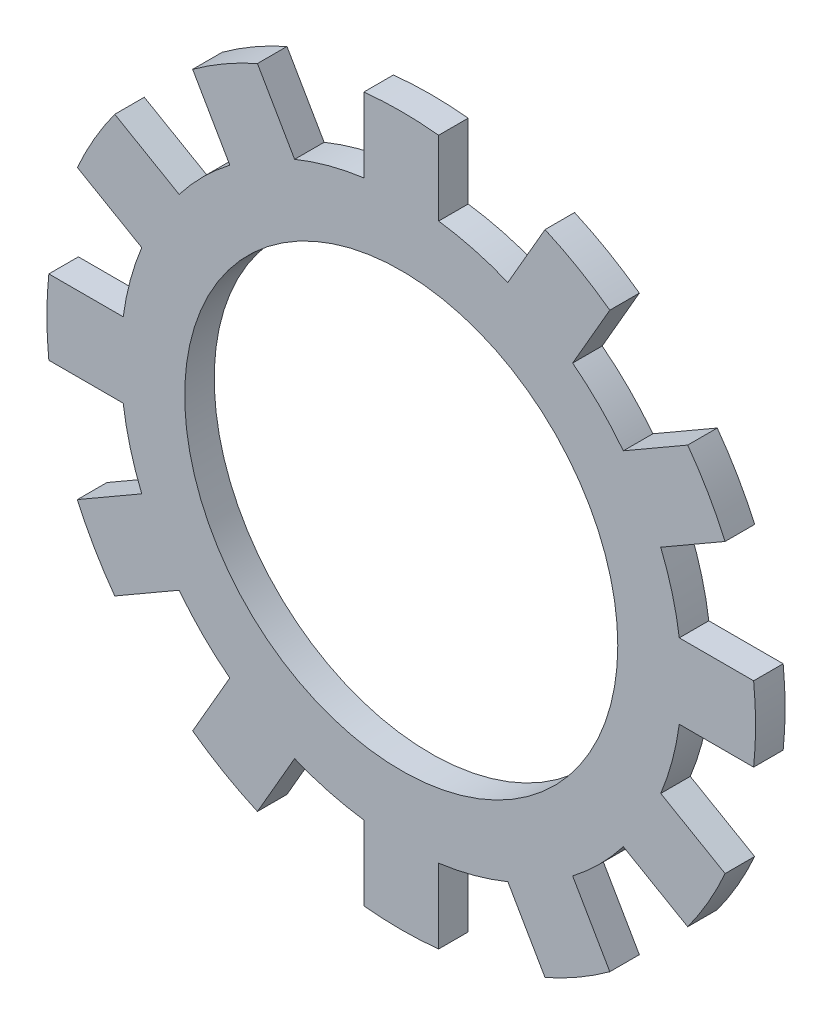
ISO-10303-21;
HEADER;
FILE_DESCRIPTION(('STEP AP214'),'2;1');
FILE_NAME('part.step','',(''),(''),'','','');
FILE_SCHEMA(('AUTOMOTIVE_DESIGN { 1 0 10303 214 1 1 1 1 }'));
ENDSEC;
DATA;
#1=APPLICATION_CONTEXT('core data for automotive mechanical design processes');
#2=APPLICATION_PROTOCOL_DEFINITION('international standard','automotive_design',2000,#1);
#3=PRODUCT_CONTEXT('',#1,'mechanical');
#4=PRODUCT('Part','Part','',(#3));
#5=PRODUCT_RELATED_PRODUCT_CATEGORY('part','',(#4));
#6=PRODUCT_DEFINITION_FORMATION('','',#4);
#7=PRODUCT_DEFINITION_CONTEXT('part definition',#1,'design');
#8=PRODUCT_DEFINITION('design','',#6,#7);
#9=PRODUCT_DEFINITION_SHAPE('','',#8);
#10=(LENGTH_UNIT() NAMED_UNIT(*) SI_UNIT(.MILLI.,.METRE.));
#11=(NAMED_UNIT(*) PLANE_ANGLE_UNIT() SI_UNIT($,.RADIAN.));
#12=(NAMED_UNIT(*) SI_UNIT($,.STERADIAN.) SOLID_ANGLE_UNIT());
#13=UNCERTAINTY_MEASURE_WITH_UNIT(LENGTH_MEASURE(1.E-05),#10,'distance_accuracy_value','');
#14=(GEOMETRIC_REPRESENTATION_CONTEXT(3) GLOBAL_UNCERTAINTY_ASSIGNED_CONTEXT((#13)) GLOBAL_UNIT_ASSIGNED_CONTEXT((#10,
#11,#12)) REPRESENTATION_CONTEXT('',''));
#15=CARTESIAN_POINT('',(0.,0.,0.));
#16=DIRECTION('',(0.,0.,1.));
#17=DIRECTION('',(1.,0.,0.));
#18=AXIS2_PLACEMENT_3D('',#15,#16,#17);
#19=CARTESIAN_POINT('',(0.,0.,0.75));
#20=DIRECTION('',(0.,0.,-1.));
#21=DIRECTION('',(-1.,0.,0.));
#22=AXIS2_PLACEMENT_3D('',#19,#20,#21);
#23=CYLINDRICAL_SURFACE('',#22,14.25);
#24=CARTESIAN_POINT('',(0.,0.,-0.75));
#25=DIRECTION('',(0.,0.,1.));
#26=DIRECTION('',(1.,0.,0.));
#27=AXIS2_PLACEMENT_3D('',#24,#25,#26);
#28=CIRCLE('',#27,14.25);
#29=CARTESIAN_POINT('',(11.2806735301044,8.70683092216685,-0.75));
#30=VERTEX_POINT('',#29);
#31=CARTESIAN_POINT('',(8.70683092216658,11.2806735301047,-0.75));
#32=VERTEX_POINT('',#31);
#33=EDGE_CURVE('E361',#30,#32,#28,.T.);
#34=ORIENTED_EDGE('',*,*,#33,.T.);
#35=DIRECTION('',(0.,0.,-1.));
#36=VECTOR('',#35,1.);
#37=CARTESIAN_POINT('',(8.70683092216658,11.2806735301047,0.75));
#38=LINE('',#37,#36);
#39=CARTESIAN_POINT('',(8.70683092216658,11.2806735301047,0.75));
#40=VERTEX_POINT('',#39);
#41=EDGE_CURVE('E352',#40,#32,#38,.T.);
#42=ORIENTED_EDGE('',*,*,#41,.F.);
#43=CARTESIAN_POINT('',(0.,0.,0.75));
#44=DIRECTION('',(0.,0.,1.));
#45=DIRECTION('',(1.,0.,0.));
#46=AXIS2_PLACEMENT_3D('',#43,#44,#45);
#47=CIRCLE('',#46,14.25);
#48=CARTESIAN_POINT('',(11.2806735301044,8.70683092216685,0.75));
#49=VERTEX_POINT('',#48);
#50=EDGE_CURVE('E64',#49,#40,#47,.T.);
#51=ORIENTED_EDGE('',*,*,#50,.F.);
#52=DIRECTION('',(0.,0.,-1.));
#53=VECTOR('',#52,1.);
#54=CARTESIAN_POINT('',(11.2806735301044,8.70683092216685,0.75));
#55=LINE('',#54,#53);
#56=EDGE_CURVE('E627',#49,#30,#55,.T.);
#57=ORIENTED_EDGE('',*,*,#56,.T.);
#58=EDGE_LOOP('',(#34,#42,#51,#57));
#59=FACE_BOUND('',#58,.T.);
#60=ADVANCED_FACE('F39',(#59),#23,.T.);
#61=DIRECTION('',(0.,0.,-1.));
#62=VECTOR('',#61,1.);
#63=CARTESIAN_POINT('',(5.41593438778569,13.1806735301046,0.75));
#64=LINE('',#63,#62);
#65=CARTESIAN_POINT('',(5.41593438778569,13.1806735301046,0.75));
#66=VERTEX_POINT('',#65);
#67=CARTESIAN_POINT('',(5.41593438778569,13.1806735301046,-0.75));
#68=VERTEX_POINT('',#67);
#69=EDGE_CURVE('E646',#66,#68,#64,.T.);
#70=ORIENTED_EDGE('',*,*,#69,.T.);
#71=CARTESIAN_POINT('',(1.9,14.1227653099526,-0.75));
#72=VERTEX_POINT('',#71);
#73=EDGE_CURVE('E388',#68,#72,#28,.T.);
#74=ORIENTED_EDGE('',*,*,#73,.T.);
#75=DIRECTION('',(0.,0.,-1.));
#76=VECTOR('',#75,1.);
#77=CARTESIAN_POINT('',(1.9,14.1227653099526,0.75));
#78=LINE('',#77,#76);
#79=CARTESIAN_POINT('',(1.9,14.1227653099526,0.75));
#80=VERTEX_POINT('',#79);
#81=EDGE_CURVE('E405',#80,#72,#78,.T.);
#82=ORIENTED_EDGE('',*,*,#81,.F.);
#83=EDGE_CURVE('E50',#66,#80,#47,.T.);
#84=ORIENTED_EDGE('',*,*,#83,.F.);
#85=EDGE_LOOP('',(#70,#74,#82,#84));
#86=FACE_BOUND('',#85,.T.);
#87=ADVANCED_FACE('F816',(#86),#23,.T.);
#88=CARTESIAN_POINT('',(14.1227653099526,1.90000000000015,-0.75));
#89=VERTEX_POINT('',#88);
#90=CARTESIAN_POINT('',(13.1806735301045,5.41593438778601,-0.75));
#91=VERTEX_POINT('',#90);
#92=EDGE_CURVE('E905',#89,#91,#28,.T.);
#93=ORIENTED_EDGE('',*,*,#92,.T.);
#94=DIRECTION('',(0.,0.,-1.));
#95=VECTOR('',#94,1.);
#96=CARTESIAN_POINT('',(13.1806735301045,5.41593438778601,0.75));
#97=LINE('',#96,#95);
#98=CARTESIAN_POINT('',(13.1806735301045,5.41593438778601,0.75));
#99=VERTEX_POINT('',#98);
#100=EDGE_CURVE('E785',#99,#91,#97,.T.);
#101=ORIENTED_EDGE('',*,*,#100,.F.);
#102=CARTESIAN_POINT('',(14.1227653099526,1.90000000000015,0.75));
#103=VERTEX_POINT('',#102);
#104=EDGE_CURVE('E371',#103,#99,#47,.T.);
#105=ORIENTED_EDGE('',*,*,#104,.F.);
#106=DIRECTION('',(0.,0.,-1.));
#107=VECTOR('',#106,1.);
#108=CARTESIAN_POINT('',(14.1227653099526,1.90000000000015,0.75));
#109=LINE('',#108,#107);
#110=EDGE_CURVE('E606',#103,#89,#109,.T.);
#111=ORIENTED_EDGE('',*,*,#110,.T.);
#112=EDGE_LOOP('',(#93,#101,#105,#111));
#113=FACE_BOUND('',#112,.T.);
#114=ADVANCED_FACE('F903',(#113),#23,.T.);
#115=CARTESIAN_POINT('',(13.1806735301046,-5.41593438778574,-0.75));
#116=VERTEX_POINT('',#115);
#117=CARTESIAN_POINT('',(14.1227653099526,-1.89999999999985,-0.75));
#118=VERTEX_POINT('',#117);
#119=EDGE_CURVE('E886',#116,#118,#28,.T.);
#120=ORIENTED_EDGE('',*,*,#119,.T.);
#121=DIRECTION('',(0.,0.,-1.));
#122=VECTOR('',#121,1.);
#123=CARTESIAN_POINT('',(14.1227653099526,-1.89999999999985,0.75));
#124=LINE('',#123,#122);
#125=CARTESIAN_POINT('',(14.1227653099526,-1.89999999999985,0.75));
#126=VERTEX_POINT('',#125);
#127=EDGE_CURVE('E771',#126,#118,#124,.T.);
#128=ORIENTED_EDGE('',*,*,#127,.F.);
#129=CARTESIAN_POINT('',(13.1806735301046,-5.41593438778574,0.75));
#130=VERTEX_POINT('',#129);
#131=EDGE_CURVE('E376',#130,#126,#47,.T.);
#132=ORIENTED_EDGE('',*,*,#131,.F.);
#133=DIRECTION('',(0.,0.,-1.));
#134=VECTOR('',#133,1.);
#135=CARTESIAN_POINT('',(13.1806735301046,-5.41593438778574,0.75));
#136=LINE('',#135,#134);
#137=EDGE_CURVE('E584',#130,#116,#136,.T.);
#138=ORIENTED_EDGE('',*,*,#137,.T.);
#139=EDGE_LOOP('',(#120,#128,#132,#138));
#140=FACE_BOUND('',#139,.T.);
#141=ADVANCED_FACE('F885',(#140),#23,.T.);
#142=CARTESIAN_POINT('',(8.70683092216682,-11.2806735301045,-0.75));
#143=VERTEX_POINT('',#142);
#144=CARTESIAN_POINT('',(11.2806735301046,-8.70683092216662,-0.75));
#145=VERTEX_POINT('',#144);
#146=EDGE_CURVE('E966',#143,#145,#28,.T.);
#147=ORIENTED_EDGE('',*,*,#146,.T.);
#148=DIRECTION('',(0.,0.,-1.));
#149=VECTOR('',#148,1.);
#150=CARTESIAN_POINT('',(11.2806735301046,-8.70683092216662,0.75));
#151=LINE('',#150,#149);
#152=CARTESIAN_POINT('',(11.2806735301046,-8.70683092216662,0.75));
#153=VERTEX_POINT('',#152);
#154=EDGE_CURVE('E757',#153,#145,#151,.T.);
#155=ORIENTED_EDGE('',*,*,#154,.F.);
#156=CARTESIAN_POINT('',(8.70683092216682,-11.2806735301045,0.75));
#157=VERTEX_POINT('',#156);
#158=EDGE_CURVE('E871',#157,#153,#47,.T.);
#159=ORIENTED_EDGE('',*,*,#158,.F.);
#160=DIRECTION('',(0.,0.,-1.));
#161=VECTOR('',#160,1.);
#162=CARTESIAN_POINT('',(8.70683092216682,-11.2806735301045,0.75));
#163=LINE('',#162,#161);
#164=EDGE_CURVE('E562',#157,#143,#163,.T.);
#165=ORIENTED_EDGE('',*,*,#164,.T.);
#166=EDGE_LOOP('',(#147,#155,#159,#165));
#167=FACE_BOUND('',#166,.T.);
#168=ADVANCED_FACE('F974',(#167),#23,.T.);
#169=CARTESIAN_POINT('',(1.9,-14.1227653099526,-0.75));
#170=VERTEX_POINT('',#169);
#171=CARTESIAN_POINT('',(5.41593438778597,-13.1806735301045,-0.75));
#172=VERTEX_POINT('',#171);
#173=EDGE_CURVE('E961',#170,#172,#28,.T.);
#174=ORIENTED_EDGE('',*,*,#173,.T.);
#175=DIRECTION('',(0.,0.,-1.));
#176=VECTOR('',#175,1.);
#177=CARTESIAN_POINT('',(5.41593438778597,-13.1806735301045,0.75));
#178=LINE('',#177,#176);
#179=CARTESIAN_POINT('',(5.41593438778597,-13.1806735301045,0.75));
#180=VERTEX_POINT('',#179);
#181=EDGE_CURVE('E743',#180,#172,#178,.T.);
#182=ORIENTED_EDGE('',*,*,#181,.F.);
#183=CARTESIAN_POINT('',(1.9,-14.1227653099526,0.75));
#184=VERTEX_POINT('',#183);
#185=EDGE_CURVE('E868',#184,#180,#47,.T.);
#186=ORIENTED_EDGE('',*,*,#185,.F.);
#187=DIRECTION('',(0.,0.,-1.));
#188=VECTOR('',#187,1.);
#189=CARTESIAN_POINT('',(1.9,-14.1227653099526,0.75));
#190=LINE('',#189,#188);
#191=EDGE_CURVE('E540',#184,#170,#190,.T.);
#192=ORIENTED_EDGE('',*,*,#191,.T.);
#193=EDGE_LOOP('',(#174,#182,#186,#192));
#194=FACE_BOUND('',#193,.T.);
#195=ADVANCED_FACE('F1402',(#194),#23,.T.);
#196=CARTESIAN_POINT('',(-5.41593438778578,-13.1806735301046,-0.75));
#197=VERTEX_POINT('',#196);
#198=CARTESIAN_POINT('',(-1.9,-14.1227653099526,-0.75));
#199=VERTEX_POINT('',#198);
#200=EDGE_CURVE('E955',#197,#199,#28,.T.);
#201=ORIENTED_EDGE('',*,*,#200,.T.);
#202=DIRECTION('',(0.,0.,-1.));
#203=VECTOR('',#202,1.);
#204=CARTESIAN_POINT('',(-1.9,-14.1227653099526,0.75));
#205=LINE('',#204,#203);
#206=CARTESIAN_POINT('',(-1.9,-14.1227653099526,0.75));
#207=VERTEX_POINT('',#206);
#208=EDGE_CURVE('E729',#207,#199,#205,.T.);
#209=ORIENTED_EDGE('',*,*,#208,.F.);
#210=CARTESIAN_POINT('',(-5.41593438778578,-13.1806735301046,0.75));
#211=VERTEX_POINT('',#210);
#212=EDGE_CURVE('E863',#211,#207,#47,.T.);
#213=ORIENTED_EDGE('',*,*,#212,.F.);
#214=DIRECTION('',(0.,0.,-1.));
#215=VECTOR('',#214,1.);
#216=CARTESIAN_POINT('',(-5.41593438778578,-13.1806735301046,0.75));
#217=LINE('',#216,#215);
#218=EDGE_CURVE('E518',#211,#197,#217,.T.);
#219=ORIENTED_EDGE('',*,*,#218,.T.);
#220=EDGE_LOOP('',(#201,#209,#213,#219));
#221=FACE_BOUND('',#220,.T.);
#222=ADVANCED_FACE('F1394',(#221),#23,.T.);
#223=CARTESIAN_POINT('',(-11.2806735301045,-8.70683092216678,-0.75));
#224=VERTEX_POINT('',#223);
#225=CARTESIAN_POINT('',(-8.70683092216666,-11.2806735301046,-0.75));
#226=VERTEX_POINT('',#225);
#227=EDGE_CURVE('E950',#224,#226,#28,.T.);
#228=ORIENTED_EDGE('',*,*,#227,.T.);
#229=DIRECTION('',(0.,0.,-1.));
#230=VECTOR('',#229,1.);
#231=CARTESIAN_POINT('',(-8.70683092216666,-11.2806735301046,0.75));
#232=LINE('',#231,#230);
#233=CARTESIAN_POINT('',(-8.70683092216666,-11.2806735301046,0.75));
#234=VERTEX_POINT('',#233);
#235=EDGE_CURVE('E715',#234,#226,#232,.T.);
#236=ORIENTED_EDGE('',*,*,#235,.F.);
#237=CARTESIAN_POINT('',(-11.2806735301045,-8.70683092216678,0.75));
#238=VERTEX_POINT('',#237);
#239=EDGE_CURVE('E858',#238,#234,#47,.T.);
#240=ORIENTED_EDGE('',*,*,#239,.F.);
#241=DIRECTION('',(0.,0.,-1.));
#242=VECTOR('',#241,1.);
#243=CARTESIAN_POINT('',(-11.2806735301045,-8.70683092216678,0.75));
#244=LINE('',#243,#242);
#245=EDGE_CURVE('E496',#238,#224,#244,.T.);
#246=ORIENTED_EDGE('',*,*,#245,.T.);
#247=EDGE_LOOP('',(#228,#236,#240,#246));
#248=FACE_BOUND('',#247,.T.);
#249=ADVANCED_FACE('F1386',(#248),#23,.T.);
#250=CARTESIAN_POINT('',(-14.1227653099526,-1.90000000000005,-0.75));
#251=VERTEX_POINT('',#250);
#252=CARTESIAN_POINT('',(-13.1806735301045,-5.41593438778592,-0.75));
#253=VERTEX_POINT('',#252);
#254=EDGE_CURVE('E946',#251,#253,#28,.T.);
#255=ORIENTED_EDGE('',*,*,#254,.T.);
#256=DIRECTION('',(0.,0.,-1.));
#257=VECTOR('',#256,1.);
#258=CARTESIAN_POINT('',(-13.1806735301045,-5.41593438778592,0.75));
#259=LINE('',#258,#257);
#260=CARTESIAN_POINT('',(-13.1806735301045,-5.41593438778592,0.75));
#261=VERTEX_POINT('',#260);
#262=EDGE_CURVE('E701',#261,#253,#259,.T.);
#263=ORIENTED_EDGE('',*,*,#262,.F.);
#264=CARTESIAN_POINT('',(-14.1227653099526,-1.90000000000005,0.75));
#265=VERTEX_POINT('',#264);
#266=EDGE_CURVE('E854',#265,#261,#47,.T.);
#267=ORIENTED_EDGE('',*,*,#266,.F.);
#268=DIRECTION('',(0.,0.,-1.));
#269=VECTOR('',#268,1.);
#270=CARTESIAN_POINT('',(-14.1227653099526,-1.90000000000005,0.75));
#271=LINE('',#270,#269);
#272=EDGE_CURVE('E474',#265,#251,#271,.T.);
#273=ORIENTED_EDGE('',*,*,#272,.T.);
#274=EDGE_LOOP('',(#255,#263,#267,#273));
#275=FACE_BOUND('',#274,.T.);
#276=ADVANCED_FACE('F938',(#275),#23,.T.);
#277=CARTESIAN_POINT('',(-13.1806735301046,5.41593438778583,-0.75));
#278=VERTEX_POINT('',#277);
#279=CARTESIAN_POINT('',(-14.1227653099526,1.89999999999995,-0.75));
#280=VERTEX_POINT('',#279);
#281=EDGE_CURVE('E943',#278,#280,#28,.T.);
#282=ORIENTED_EDGE('',*,*,#281,.T.);
#283=DIRECTION('',(0.,0.,-1.));
#284=VECTOR('',#283,1.);
#285=CARTESIAN_POINT('',(-14.1227653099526,1.89999999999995,0.75));
#286=LINE('',#285,#284);
#287=CARTESIAN_POINT('',(-14.1227653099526,1.89999999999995,0.75));
#288=VERTEX_POINT('',#287);
#289=EDGE_CURVE('E687',#288,#280,#286,.T.);
#290=ORIENTED_EDGE('',*,*,#289,.F.);
#291=CARTESIAN_POINT('',(-13.1806735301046,5.41593438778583,0.75));
#292=VERTEX_POINT('',#291);
#293=EDGE_CURVE('E851',#292,#288,#47,.T.);
#294=ORIENTED_EDGE('',*,*,#293,.F.);
#295=DIRECTION('',(0.,0.,-1.));
#296=VECTOR('',#295,1.);
#297=CARTESIAN_POINT('',(-13.1806735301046,5.41593438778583,0.75));
#298=LINE('',#297,#296);
#299=EDGE_CURVE('E452',#292,#278,#298,.T.);
#300=ORIENTED_EDGE('',*,*,#299,.T.);
#301=EDGE_LOOP('',(#282,#290,#294,#300));
#302=FACE_BOUND('',#301,.T.);
#303=ADVANCED_FACE('F934',(#302),#23,.T.);
#304=CARTESIAN_POINT('',(-8.70683092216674,11.2806735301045,-0.75));
#305=VERTEX_POINT('',#304);
#306=CARTESIAN_POINT('',(-11.2806735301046,8.7068309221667,-0.75));
#307=VERTEX_POINT('',#306);
#308=EDGE_CURVE('E941',#305,#307,#28,.T.);
#309=ORIENTED_EDGE('',*,*,#308,.T.);
#310=DIRECTION('',(0.,0.,-1.));
#311=VECTOR('',#310,1.);
#312=CARTESIAN_POINT('',(-11.2806735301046,8.7068309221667,0.75));
#313=LINE('',#312,#311);
#314=CARTESIAN_POINT('',(-11.2806735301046,8.7068309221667,0.75));
#315=VERTEX_POINT('',#314);
#316=EDGE_CURVE('E673',#315,#307,#313,.T.);
#317=ORIENTED_EDGE('',*,*,#316,.F.);
#318=CARTESIAN_POINT('',(-8.70683092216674,11.2806735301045,0.75));
#319=VERTEX_POINT('',#318);
#320=EDGE_CURVE('E49',#319,#315,#47,.T.);
#321=ORIENTED_EDGE('',*,*,#320,.F.);
#322=DIRECTION('',(0.,0.,-1.));
#323=VECTOR('',#322,1.);
#324=CARTESIAN_POINT('',(-8.70683092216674,11.2806735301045,0.75));
#325=LINE('',#324,#323);
#326=EDGE_CURVE('E430',#319,#305,#325,.T.);
#327=ORIENTED_EDGE('',*,*,#326,.T.);
#328=EDGE_LOOP('',(#309,#317,#321,#327));
#329=FACE_BOUND('',#328,.T.);
#330=ADVANCED_FACE('F928',(#329),#23,.T.);
#331=CARTESIAN_POINT('',(-1.9,14.1227653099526,-0.75));
#332=VERTEX_POINT('',#331);
#333=CARTESIAN_POINT('',(-5.41593438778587,13.1806735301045,-0.75));
#334=VERTEX_POINT('',#333);
#335=EDGE_CURVE('E43',#332,#334,#28,.T.);
#336=ORIENTED_EDGE('',*,*,#335,.T.);
#337=DIRECTION('',(0.,0.,-1.));
#338=VECTOR('',#337,1.);
#339=CARTESIAN_POINT('',(-5.41593438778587,13.1806735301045,0.75));
#340=LINE('',#339,#338);
#341=CARTESIAN_POINT('',(-5.41593438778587,13.1806735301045,0.75));
#342=VERTEX_POINT('',#341);
#343=EDGE_CURVE('E657',#342,#334,#340,.T.);
#344=ORIENTED_EDGE('',*,*,#343,.F.);
#345=CARTESIAN_POINT('',(-1.9,14.1227653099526,0.75));
#346=VERTEX_POINT('',#345);
#347=EDGE_CURVE('E11',#346,#342,#47,.T.);
#348=ORIENTED_EDGE('',*,*,#347,.F.);
#349=DIRECTION('',(0.,0.,-1.));
#350=VECTOR('',#349,1.);
#351=CARTESIAN_POINT('',(-1.9,14.1227653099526,0.75));
#352=LINE('',#351,#350);
#353=EDGE_CURVE('E392',#346,#332,#352,.T.);
#354=ORIENTED_EDGE('',*,*,#353,.T.);
#355=EDGE_LOOP('',(#336,#344,#348,#354));
#356=FACE_BOUND('',#355,.T.);
#357=ADVANCED_FACE('F41',(#356),#23,.T.);
#358=CARTESIAN_POINT('',(0.,0.,0.75));
#359=DIRECTION('',(0.,0.,1.));
#360=DIRECTION('',(1.,0.,0.));
#361=AXIS2_PLACEMENT_3D('',#358,#359,#360);
#362=PLANE('',#361);
#363=ORIENTED_EDGE('',*,*,#347,.T.);
#364=DIRECTION('',(0.500000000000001,-0.866025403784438,0.));
#365=VECTOR('',#364,1.);
#366=CARTESIAN_POINT('',(-7.30427239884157,16.4513709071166,0.75));
#367=LINE('',#366,#365);
#368=CARTESIAN_POINT('',(-7.30427239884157,16.4513709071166,0.75));
#369=VERTEX_POINT('',#368);
#370=EDGE_CURVE('E668',#369,#342,#367,.T.);
#371=ORIENTED_EDGE('',*,*,#370,.F.);
#372=CARTESIAN_POINT('',(0.,0.,0.75));
#373=DIRECTION('',(0.,0.,1.));
#374=DIRECTION('',(0.866025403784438,0.500000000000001,0.));
#375=AXIS2_PLACEMENT_3D('',#372,#373,#374);
#376=CIRCLE('',#375,18.);
#377=CARTESIAN_POINT('',(-10.5951689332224,14.5513709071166,0.75));
#378=VERTEX_POINT('',#377);
#379=EDGE_CURVE('E439',#369,#378,#376,.T.);
#380=ORIENTED_EDGE('',*,*,#379,.T.);
#381=DIRECTION('',(0.500000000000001,-0.866025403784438,0.));
#382=VECTOR('',#381,1.);
#383=CARTESIAN_POINT('',(-10.5951689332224,14.5513709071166,0.75));
#384=LINE('',#383,#382);
#385=EDGE_CURVE('E434',#378,#319,#384,.T.);
#386=ORIENTED_EDGE('',*,*,#385,.T.);
#387=ORIENTED_EDGE('',*,*,#320,.T.);
#388=DIRECTION('',(0.86602540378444,-0.499999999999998,0.));
#389=VECTOR('',#388,1.);
#390=CARTESIAN_POINT('',(-14.5513709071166,10.5951689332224,0.75));
#391=LINE('',#390,#389);
#392=CARTESIAN_POINT('',(-14.5513709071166,10.5951689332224,0.75));
#393=VERTEX_POINT('',#392);
#394=EDGE_CURVE('E682',#393,#315,#391,.T.);
#395=ORIENTED_EDGE('',*,*,#394,.F.);
#396=CARTESIAN_POINT('',(0.,0.,0.75));
#397=DIRECTION('',(0.,0.,1.));
#398=DIRECTION('',(0.499999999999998,0.86602540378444,0.));
#399=AXIS2_PLACEMENT_3D('',#396,#397,#398);
#400=CIRCLE('',#399,18.);
#401=CARTESIAN_POINT('',(-16.4513709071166,7.30427239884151,0.75));
#402=VERTEX_POINT('',#401);
#403=EDGE_CURVE('E461',#393,#402,#400,.T.);
#404=ORIENTED_EDGE('',*,*,#403,.T.);
#405=DIRECTION('',(0.86602540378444,-0.499999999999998,0.));
#406=VECTOR('',#405,1.);
#407=CARTESIAN_POINT('',(-16.4513709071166,7.30427239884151,0.75));
#408=LINE('',#407,#406);
#409=EDGE_CURVE('E456',#402,#292,#408,.T.);
#410=ORIENTED_EDGE('',*,*,#409,.T.);
#411=ORIENTED_EDGE('',*,*,#293,.T.);
#412=DIRECTION('',(1.,0.,0.));
#413=VECTOR('',#412,1.);
#414=CARTESIAN_POINT('',(-17.899441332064,1.89999999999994,0.75));
#415=LINE('',#414,#413);
#416=CARTESIAN_POINT('',(-17.899441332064,1.89999999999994,0.75));
#417=VERTEX_POINT('',#416);
#418=EDGE_CURVE('E696',#417,#288,#415,.T.);
#419=ORIENTED_EDGE('',*,*,#418,.F.);
#420=CARTESIAN_POINT('',(0.,0.,0.75));
#421=DIRECTION('',(0.,0.,1.));
#422=DIRECTION('',(0.,1.,0.));
#423=AXIS2_PLACEMENT_3D('',#420,#421,#422);
#424=CIRCLE('',#423,18.);
#425=CARTESIAN_POINT('',(-17.899441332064,-1.90000000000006,0.75));
#426=VERTEX_POINT('',#425);
#427=EDGE_CURVE('E483',#417,#426,#424,.T.);
#428=ORIENTED_EDGE('',*,*,#427,.T.);
#429=DIRECTION('',(1.,0.,0.));
#430=VECTOR('',#429,1.);
#431=CARTESIAN_POINT('',(-17.899441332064,-1.90000000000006,0.75));
#432=LINE('',#431,#430);
#433=EDGE_CURVE('E478',#426,#265,#432,.T.);
#434=ORIENTED_EDGE('',*,*,#433,.T.);
#435=ORIENTED_EDGE('',*,*,#266,.T.);
#436=DIRECTION('',(0.866025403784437,0.500000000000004,0.));
#437=VECTOR('',#436,1.);
#438=CARTESIAN_POINT('',(-16.4513709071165,-7.30427239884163,0.75));
#439=LINE('',#438,#437);
#440=CARTESIAN_POINT('',(-16.4513709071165,-7.30427239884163,0.75));
#441=VERTEX_POINT('',#440);
#442=EDGE_CURVE('E710',#441,#261,#439,.T.);
#443=ORIENTED_EDGE('',*,*,#442,.F.);
#444=CARTESIAN_POINT('',(0.,0.,0.75));
#445=DIRECTION('',(0.,0.,1.));
#446=DIRECTION('',(-0.500000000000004,0.866025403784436,0.));
#447=AXIS2_PLACEMENT_3D('',#444,#445,#446);
#448=CIRCLE('',#447,18.);
#449=CARTESIAN_POINT('',(-14.5513709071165,-10.5951689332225,0.75));
#450=VERTEX_POINT('',#449);
#451=EDGE_CURVE('E505',#441,#450,#448,.T.);
#452=ORIENTED_EDGE('',*,*,#451,.T.);
#453=DIRECTION('',(0.866025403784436,0.500000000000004,0.));
#454=VECTOR('',#453,1.);
#455=CARTESIAN_POINT('',(-14.5513709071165,-10.5951689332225,0.75));
#456=LINE('',#455,#454);
#457=EDGE_CURVE('E500',#450,#238,#456,.T.);
#458=ORIENTED_EDGE('',*,*,#457,.T.);
#459=ORIENTED_EDGE('',*,*,#239,.T.);
#460=DIRECTION('',(0.499999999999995,0.866025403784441,0.));
#461=VECTOR('',#460,1.);
#462=CARTESIAN_POINT('',(-10.5951689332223,-14.5513709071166,0.75));
#463=LINE('',#462,#461);
#464=CARTESIAN_POINT('',(-10.5951689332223,-14.5513709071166,0.75));
#465=VERTEX_POINT('',#464);
#466=EDGE_CURVE('E724',#465,#234,#463,.T.);
#467=ORIENTED_EDGE('',*,*,#466,.F.);
#468=CARTESIAN_POINT('',(0.,0.,0.75));
#469=DIRECTION('',(0.,0.,1.));
#470=DIRECTION('',(-0.866025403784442,0.499999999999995,0.));
#471=AXIS2_PLACEMENT_3D('',#468,#469,#470);
#472=CIRCLE('',#471,18.);
#473=CARTESIAN_POINT('',(-7.30427239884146,-16.4513709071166,0.75));
#474=VERTEX_POINT('',#473);
#475=EDGE_CURVE('E527',#465,#474,#472,.T.);
#476=ORIENTED_EDGE('',*,*,#475,.T.);
#477=DIRECTION('',(0.499999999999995,0.866025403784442,0.));
#478=VECTOR('',#477,1.);
#479=CARTESIAN_POINT('',(-7.30427239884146,-16.4513709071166,0.75));
#480=LINE('',#479,#478);
#481=EDGE_CURVE('E522',#474,#211,#480,.T.);
#482=ORIENTED_EDGE('',*,*,#481,.T.);
#483=ORIENTED_EDGE('',*,*,#212,.T.);
#484=DIRECTION('',(0.,1.,0.));
#485=VECTOR('',#484,1.);
#486=CARTESIAN_POINT('',(-1.9,-17.899441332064,0.75));
#487=LINE('',#486,#485);
#488=CARTESIAN_POINT('',(-1.9,-17.899441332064,0.75));
#489=VERTEX_POINT('',#488);
#490=EDGE_CURVE('E738',#489,#207,#487,.T.);
#491=ORIENTED_EDGE('',*,*,#490,.F.);
#492=CARTESIAN_POINT('',(0.,0.,0.75));
#493=DIRECTION('',(0.,0.,1.));
#494=DIRECTION('',(-1.,0.,0.));
#495=AXIS2_PLACEMENT_3D('',#492,#493,#494);
#496=CIRCLE('',#495,18.);
#497=CARTESIAN_POINT('',(1.9,-17.899441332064,0.75));
#498=VERTEX_POINT('',#497);
#499=EDGE_CURVE('E549',#489,#498,#496,.T.);
#500=ORIENTED_EDGE('',*,*,#499,.T.);
#501=DIRECTION('',(0.,1.,0.));
#502=VECTOR('',#501,1.);
#503=CARTESIAN_POINT('',(1.9,-17.899441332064,0.75));
#504=LINE('',#503,#502);
#505=EDGE_CURVE('E544',#498,#184,#504,.T.);
#506=ORIENTED_EDGE('',*,*,#505,.T.);
#507=ORIENTED_EDGE('',*,*,#185,.T.);
#508=DIRECTION('',(-0.500000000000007,0.866025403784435,0.));
#509=VECTOR('',#508,1.);
#510=CARTESIAN_POINT('',(7.30427239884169,-16.4513709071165,0.75));
#511=LINE('',#510,#509);
#512=CARTESIAN_POINT('',(7.30427239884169,-16.4513709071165,0.75));
#513=VERTEX_POINT('',#512);
#514=EDGE_CURVE('E752',#513,#180,#511,.T.);
#515=ORIENTED_EDGE('',*,*,#514,.F.);
#516=CARTESIAN_POINT('',(0.,0.,0.75));
#517=DIRECTION('',(0.,0.,1.));
#518=DIRECTION('',(-0.866025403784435,-0.500000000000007,0.));
#519=AXIS2_PLACEMENT_3D('',#516,#517,#518);
#520=CIRCLE('',#519,18.);
#521=CARTESIAN_POINT('',(10.5951689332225,-14.5513709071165,0.75));
#522=VERTEX_POINT('',#521);
#523=EDGE_CURVE('E571',#513,#522,#520,.T.);
#524=ORIENTED_EDGE('',*,*,#523,.T.);
#525=DIRECTION('',(-0.500000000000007,0.866025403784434,0.));
#526=VECTOR('',#525,1.);
#527=CARTESIAN_POINT('',(10.5951689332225,-14.5513709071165,0.75));
#528=LINE('',#527,#526);
#529=EDGE_CURVE('E566',#522,#157,#528,.T.);
#530=ORIENTED_EDGE('',*,*,#529,.T.);
#531=ORIENTED_EDGE('',*,*,#158,.T.);
#532=DIRECTION('',(-0.866025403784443,0.499999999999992,0.));
#533=VECTOR('',#532,1.);
#534=CARTESIAN_POINT('',(14.5513709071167,-10.5951689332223,0.75));
#535=LINE('',#534,#533);
#536=CARTESIAN_POINT('',(14.5513709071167,-10.5951689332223,0.75));
#537=VERTEX_POINT('',#536);
#538=EDGE_CURVE('E766',#537,#153,#535,.T.);
#539=ORIENTED_EDGE('',*,*,#538,.F.);
#540=CARTESIAN_POINT('',(0.,0.,0.75));
#541=DIRECTION('',(0.,0.,1.));
#542=DIRECTION('',(-0.499999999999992,-0.866025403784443,0.));
#543=AXIS2_PLACEMENT_3D('',#540,#541,#542);
#544=CIRCLE('',#543,18.);
#545=CARTESIAN_POINT('',(16.4513709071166,-7.3042723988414,0.75));
#546=VERTEX_POINT('',#545);
#547=EDGE_CURVE('E593',#537,#546,#544,.T.);
#548=ORIENTED_EDGE('',*,*,#547,.T.);
#549=DIRECTION('',(-0.866025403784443,0.499999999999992,0.));
#550=VECTOR('',#549,1.);
#551=CARTESIAN_POINT('',(16.4513709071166,-7.3042723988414,0.75));
#552=LINE('',#551,#550);
#553=EDGE_CURVE('E588',#546,#130,#552,.T.);
#554=ORIENTED_EDGE('',*,*,#553,.T.);
#555=ORIENTED_EDGE('',*,*,#131,.T.);
#556=DIRECTION('',(-1.,0.,0.));
#557=VECTOR('',#556,1.);
#558=CARTESIAN_POINT('',(17.899441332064,-1.89999999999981,0.75));
#559=LINE('',#558,#557);
#560=CARTESIAN_POINT('',(17.899441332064,-1.89999999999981,0.75));
#561=VERTEX_POINT('',#560);
#562=EDGE_CURVE('E780',#561,#126,#559,.T.);
#563=ORIENTED_EDGE('',*,*,#562,.F.);
#564=CARTESIAN_POINT('',(0.,0.,0.75));
#565=DIRECTION('',(0.,0.,1.));
#566=DIRECTION('',(0.,-1.,0.));
#567=AXIS2_PLACEMENT_3D('',#564,#565,#566);
#568=CIRCLE('',#567,18.);
#569=CARTESIAN_POINT('',(17.8994413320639,1.90000000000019,0.75));
#570=VERTEX_POINT('',#569);
#571=EDGE_CURVE('E615',#561,#570,#568,.T.);
#572=ORIENTED_EDGE('',*,*,#571,.T.);
#573=DIRECTION('',(-1.,0.,0.));
#574=VECTOR('',#573,1.);
#575=CARTESIAN_POINT('',(17.8994413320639,1.90000000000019,0.75));
#576=LINE('',#575,#574);
#577=EDGE_CURVE('E610',#570,#103,#576,.T.);
#578=ORIENTED_EDGE('',*,*,#577,.T.);
#579=ORIENTED_EDGE('',*,*,#104,.T.);
#580=DIRECTION('',(-0.866025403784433,-0.50000000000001,0.));
#581=VECTOR('',#580,1.);
#582=CARTESIAN_POINT('',(16.4513709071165,7.30427239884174,0.75));
#583=LINE('',#582,#581);
#584=CARTESIAN_POINT('',(16.4513709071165,7.30427239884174,0.75));
#585=VERTEX_POINT('',#584);
#586=EDGE_CURVE('E794',#585,#99,#583,.T.);
#587=ORIENTED_EDGE('',*,*,#586,.F.);
#588=CARTESIAN_POINT('',(0.,0.,0.75));
#589=DIRECTION('',(0.,0.,1.));
#590=DIRECTION('',(0.50000000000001,-0.866025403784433,0.));
#591=AXIS2_PLACEMENT_3D('',#588,#589,#590);
#592=CIRCLE('',#591,18.);
#593=CARTESIAN_POINT('',(14.5513709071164,10.5951689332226,0.75));
#594=VERTEX_POINT('',#593);
#595=EDGE_CURVE('E634',#585,#594,#592,.T.);
#596=ORIENTED_EDGE('',*,*,#595,.T.);
#597=DIRECTION('',(-0.866025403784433,-0.50000000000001,0.));
#598=VECTOR('',#597,1.);
#599=CARTESIAN_POINT('',(14.5513709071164,10.5951689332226,0.75));
#600=LINE('',#599,#598);
#601=EDGE_CURVE('E368',#594,#49,#600,.T.);
#602=ORIENTED_EDGE('',*,*,#601,.T.);
#603=ORIENTED_EDGE('',*,*,#50,.T.);
#604=DIRECTION('',(-0.499999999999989,-0.866025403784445,0.));
#605=VECTOR('',#604,1.);
#606=CARTESIAN_POINT('',(10.5951689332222,14.5513709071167,0.75));
#607=LINE('',#606,#605);
#608=CARTESIAN_POINT('',(10.5951689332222,14.5513709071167,0.75));
#609=VERTEX_POINT('',#608);
#610=EDGE_CURVE('E349',#609,#40,#607,.T.);
#611=ORIENTED_EDGE('',*,*,#610,.F.);
#612=CARTESIAN_POINT('',(0.,0.,0.75));
#613=DIRECTION('',(0.,0.,1.));
#614=DIRECTION('',(0.866025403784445,-0.499999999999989,0.));
#615=AXIS2_PLACEMENT_3D('',#612,#613,#614);
#616=CIRCLE('',#615,18.);
#617=CARTESIAN_POINT('',(7.30427239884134,16.4513709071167,0.75));
#618=VERTEX_POINT('',#617);
#619=EDGE_CURVE('E653',#609,#618,#616,.T.);
#620=ORIENTED_EDGE('',*,*,#619,.T.);
#621=DIRECTION('',(-0.499999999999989,-0.866025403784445,0.));
#622=VECTOR('',#621,1.);
#623=CARTESIAN_POINT('',(7.30427239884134,16.4513709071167,0.75));
#624=LINE('',#623,#622);
#625=EDGE_CURVE('E648',#618,#66,#624,.T.);
#626=ORIENTED_EDGE('',*,*,#625,.T.);
#627=ORIENTED_EDGE('',*,*,#83,.T.);
#628=DIRECTION('',(0.,-1.,0.));
#629=VECTOR('',#628,1.);
#630=CARTESIAN_POINT('',(1.9,17.899441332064,0.75));
#631=LINE('',#630,#629);
#632=CARTESIAN_POINT('',(1.9,17.899441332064,0.75));
#633=VERTEX_POINT('',#632);
#634=EDGE_CURVE('E418',#633,#80,#631,.T.);
#635=ORIENTED_EDGE('',*,*,#634,.F.);
#636=CARTESIAN_POINT('',(0.,0.,0.75));
#637=DIRECTION('',(0.,0.,1.));
#638=DIRECTION('',(1.,0.,0.));
#639=AXIS2_PLACEMENT_3D('',#636,#637,#638);
#640=CIRCLE('',#639,18.);
#641=CARTESIAN_POINT('',(-1.9,17.899441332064,0.75));
#642=VERTEX_POINT('',#641);
#643=EDGE_CURVE('E401',#633,#642,#640,.T.);
#644=ORIENTED_EDGE('',*,*,#643,.T.);
#645=DIRECTION('',(0.,-1.,0.));
#646=VECTOR('',#645,1.);
#647=CARTESIAN_POINT('',(-1.9,17.899441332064,0.75));
#648=LINE('',#647,#646);
#649=EDGE_CURVE('E396',#642,#346,#648,.T.);
#650=ORIENTED_EDGE('',*,*,#649,.T.);
#651=EDGE_LOOP('',(#363,#371,#380,#386,#387,#395,#404,#410,#411,#419,#428,#434,#435,#443,#452,
#458,#459,#467,#476,#482,#483,#491,#500,#506,#507,#515,#524,#530,#531,#539,#548,#554,#555,#563,
#572,#578,#579,#587,#596,#602,#603,#611,#620,#626,#627,#635,#644,#650));
#652=FACE_BOUND('',#651,.T.);
#653=CARTESIAN_POINT('',(0.,0.,0.75));
#654=DIRECTION('',(0.,0.,1.));
#655=DIRECTION('',(1.,0.,0.));
#656=AXIS2_PLACEMENT_3D('',#653,#654,#655);
#657=CIRCLE('',#656,11.);
#658=CARTESIAN_POINT('',(11.,0.,0.75));
#659=VERTEX_POINT('',#658);
#660=EDGE_CURVE('E383',#659,#659,#657,.T.);
#661=ORIENTED_EDGE('',*,*,#660,.F.);
#662=EDGE_LOOP('',(#661));
#663=FACE_BOUND('',#662,.T.);
#664=ADVANCED_FACE('F365',(#652,#663),#362,.T.);
#665=CARTESIAN_POINT('',(0.,0.,-0.75));
#666=DIRECTION('',(0.,0.,1.));
#667=DIRECTION('',(1.,0.,0.));
#668=AXIS2_PLACEMENT_3D('',#665,#666,#667);
#669=PLANE('',#668);
#670=ORIENTED_EDGE('',*,*,#335,.F.);
#671=DIRECTION('',(0.,-1.,0.));
#672=VECTOR('',#671,1.);
#673=CARTESIAN_POINT('',(-1.9,17.899441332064,-0.75));
#674=LINE('',#673,#672);
#675=CARTESIAN_POINT('',(-1.9,17.899441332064,-0.75));
#676=VERTEX_POINT('',#675);
#677=EDGE_CURVE('E397',#676,#332,#674,.T.);
#678=ORIENTED_EDGE('',*,*,#677,.F.);
#679=CARTESIAN_POINT('',(0.,0.,-0.75));
#680=DIRECTION('',(0.,0.,1.));
#681=DIRECTION('',(1.,0.,0.));
#682=AXIS2_PLACEMENT_3D('',#679,#680,#681);
#683=CIRCLE('',#682,18.);
#684=CARTESIAN_POINT('',(1.9,17.899441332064,-0.75));
#685=VERTEX_POINT('',#684);
#686=EDGE_CURVE('E402',#685,#676,#683,.T.);
#687=ORIENTED_EDGE('',*,*,#686,.F.);
#688=DIRECTION('',(0.,-1.,0.));
#689=VECTOR('',#688,1.);
#690=CARTESIAN_POINT('',(1.9,17.899441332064,-0.75));
#691=LINE('',#690,#689);
#692=EDGE_CURVE('E419',#685,#72,#691,.T.);
#693=ORIENTED_EDGE('',*,*,#692,.T.);
#694=ORIENTED_EDGE('',*,*,#73,.F.);
#695=DIRECTION('',(-0.499999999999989,-0.866025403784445,0.));
#696=VECTOR('',#695,1.);
#697=CARTESIAN_POINT('',(7.30427239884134,16.4513709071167,-0.75));
#698=LINE('',#697,#696);
#699=CARTESIAN_POINT('',(7.30427239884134,16.4513709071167,-0.75));
#700=VERTEX_POINT('',#699);
#701=EDGE_CURVE('E649',#700,#68,#698,.T.);
#702=ORIENTED_EDGE('',*,*,#701,.F.);
#703=CARTESIAN_POINT('',(0.,0.,-0.75));
#704=DIRECTION('',(0.,0.,1.));
#705=DIRECTION('',(0.866025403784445,-0.499999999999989,0.));
#706=AXIS2_PLACEMENT_3D('',#703,#704,#705);
#707=CIRCLE('',#706,18.);
#708=CARTESIAN_POINT('',(10.5951689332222,14.5513709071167,-0.75));
#709=VERTEX_POINT('',#708);
#710=EDGE_CURVE('E654',#709,#700,#707,.T.);
#711=ORIENTED_EDGE('',*,*,#710,.F.);
#712=DIRECTION('',(-0.499999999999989,-0.866025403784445,0.));
#713=VECTOR('',#712,1.);
#714=CARTESIAN_POINT('',(10.5951689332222,14.5513709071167,-0.75));
#715=LINE('',#714,#713);
#716=EDGE_CURVE('E358',#709,#32,#715,.T.);
#717=ORIENTED_EDGE('',*,*,#716,.T.);
#718=ORIENTED_EDGE('',*,*,#33,.F.);
#719=DIRECTION('',(-0.866025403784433,-0.50000000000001,0.));
#720=VECTOR('',#719,1.);
#721=CARTESIAN_POINT('',(14.5513709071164,10.5951689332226,-0.75));
#722=LINE('',#721,#720);
#723=CARTESIAN_POINT('',(14.5513709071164,10.5951689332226,-0.75));
#724=VERTEX_POINT('',#723);
#725=EDGE_CURVE('E630',#724,#30,#722,.T.);
#726=ORIENTED_EDGE('',*,*,#725,.F.);
#727=CARTESIAN_POINT('',(0.,0.,-0.75));
#728=DIRECTION('',(0.,0.,1.));
#729=DIRECTION('',(0.50000000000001,-0.866025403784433,0.));
#730=AXIS2_PLACEMENT_3D('',#727,#728,#729);
#731=CIRCLE('',#730,18.);
#732=CARTESIAN_POINT('',(16.4513709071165,7.30427239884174,-0.75));
#733=VERTEX_POINT('',#732);
#734=EDGE_CURVE('E635',#733,#724,#731,.T.);
#735=ORIENTED_EDGE('',*,*,#734,.F.);
#736=DIRECTION('',(-0.866025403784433,-0.50000000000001,0.));
#737=VECTOR('',#736,1.);
#738=CARTESIAN_POINT('',(16.4513709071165,7.30427239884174,-0.75));
#739=LINE('',#738,#737);
#740=EDGE_CURVE('E363',#733,#91,#739,.T.);
#741=ORIENTED_EDGE('',*,*,#740,.T.);
#742=ORIENTED_EDGE('',*,*,#92,.F.);
#743=DIRECTION('',(-1.,0.,0.));
#744=VECTOR('',#743,1.);
#745=CARTESIAN_POINT('',(17.8994413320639,1.90000000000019,-0.75));
#746=LINE('',#745,#744);
#747=CARTESIAN_POINT('',(17.8994413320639,1.90000000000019,-0.75));
#748=VERTEX_POINT('',#747);
#749=EDGE_CURVE('E611',#748,#89,#746,.T.);
#750=ORIENTED_EDGE('',*,*,#749,.F.);
#751=CARTESIAN_POINT('',(0.,0.,-0.75));
#752=DIRECTION('',(0.,0.,1.));
#753=DIRECTION('',(0.,-1.,0.));
#754=AXIS2_PLACEMENT_3D('',#751,#752,#753);
#755=CIRCLE('',#754,18.);
#756=CARTESIAN_POINT('',(17.899441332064,-1.89999999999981,-0.75));
#757=VERTEX_POINT('',#756);
#758=EDGE_CURVE('E616',#757,#748,#755,.T.);
#759=ORIENTED_EDGE('',*,*,#758,.F.);
#760=DIRECTION('',(-1.,0.,0.));
#761=VECTOR('',#760,1.);
#762=CARTESIAN_POINT('',(17.899441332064,-1.89999999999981,-0.75));
#763=LINE('',#762,#761);
#764=EDGE_CURVE('E781',#757,#118,#763,.T.);
#765=ORIENTED_EDGE('',*,*,#764,.T.);
#766=ORIENTED_EDGE('',*,*,#119,.F.);
#767=DIRECTION('',(-0.866025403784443,0.499999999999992,0.));
#768=VECTOR('',#767,1.);
#769=CARTESIAN_POINT('',(16.4513709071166,-7.3042723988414,-0.75));
#770=LINE('',#769,#768);
#771=CARTESIAN_POINT('',(16.4513709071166,-7.3042723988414,-0.75));
#772=VERTEX_POINT('',#771);
#773=EDGE_CURVE('E589',#772,#116,#770,.T.);
#774=ORIENTED_EDGE('',*,*,#773,.F.);
#775=CARTESIAN_POINT('',(0.,0.,-0.75));
#776=DIRECTION('',(0.,0.,1.));
#777=DIRECTION('',(-0.499999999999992,-0.866025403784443,0.));
#778=AXIS2_PLACEMENT_3D('',#775,#776,#777);
#779=CIRCLE('',#778,18.);
#780=CARTESIAN_POINT('',(14.5513709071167,-10.5951689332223,-0.75));
#781=VERTEX_POINT('',#780);
#782=EDGE_CURVE('E594',#781,#772,#779,.T.);
#783=ORIENTED_EDGE('',*,*,#782,.F.);
#784=DIRECTION('',(-0.866025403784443,0.499999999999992,0.));
#785=VECTOR('',#784,1.);
#786=CARTESIAN_POINT('',(14.5513709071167,-10.5951689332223,-0.75));
#787=LINE('',#786,#785);
#788=EDGE_CURVE('E767',#781,#145,#787,.T.);
#789=ORIENTED_EDGE('',*,*,#788,.T.);
#790=ORIENTED_EDGE('',*,*,#146,.F.);
#791=DIRECTION('',(-0.500000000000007,0.866025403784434,0.));
#792=VECTOR('',#791,1.);
#793=CARTESIAN_POINT('',(10.5951689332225,-14.5513709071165,-0.75));
#794=LINE('',#793,#792);
#795=CARTESIAN_POINT('',(10.5951689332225,-14.5513709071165,-0.75));
#796=VERTEX_POINT('',#795);
#797=EDGE_CURVE('E567',#796,#143,#794,.T.);
#798=ORIENTED_EDGE('',*,*,#797,.F.);
#799=CARTESIAN_POINT('',(0.,0.,-0.75));
#800=DIRECTION('',(0.,0.,1.));
#801=DIRECTION('',(-0.866025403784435,-0.500000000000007,0.));
#802=AXIS2_PLACEMENT_3D('',#799,#800,#801);
#803=CIRCLE('',#802,18.);
#804=CARTESIAN_POINT('',(7.30427239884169,-16.4513709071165,-0.75));
#805=VERTEX_POINT('',#804);
#806=EDGE_CURVE('E572',#805,#796,#803,.T.);
#807=ORIENTED_EDGE('',*,*,#806,.F.);
#808=DIRECTION('',(-0.500000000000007,0.866025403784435,0.));
#809=VECTOR('',#808,1.);
#810=CARTESIAN_POINT('',(7.30427239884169,-16.4513709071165,-0.75));
#811=LINE('',#810,#809);
#812=EDGE_CURVE('E753',#805,#172,#811,.T.);
#813=ORIENTED_EDGE('',*,*,#812,.T.);
#814=ORIENTED_EDGE('',*,*,#173,.F.);
#815=DIRECTION('',(0.,1.,0.));
#816=VECTOR('',#815,1.);
#817=CARTESIAN_POINT('',(1.9,-17.899441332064,-0.75));
#818=LINE('',#817,#816);
#819=CARTESIAN_POINT('',(1.9,-17.899441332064,-0.75));
#820=VERTEX_POINT('',#819);
#821=EDGE_CURVE('E545',#820,#170,#818,.T.);
#822=ORIENTED_EDGE('',*,*,#821,.F.);
#823=CARTESIAN_POINT('',(0.,0.,-0.75));
#824=DIRECTION('',(0.,0.,1.));
#825=DIRECTION('',(-1.,0.,0.));
#826=AXIS2_PLACEMENT_3D('',#823,#824,#825);
#827=CIRCLE('',#826,18.);
#828=CARTESIAN_POINT('',(-1.9,-17.899441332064,-0.75));
#829=VERTEX_POINT('',#828);
#830=EDGE_CURVE('E550',#829,#820,#827,.T.);
#831=ORIENTED_EDGE('',*,*,#830,.F.);
#832=DIRECTION('',(0.,1.,0.));
#833=VECTOR('',#832,1.);
#834=CARTESIAN_POINT('',(-1.9,-17.899441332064,-0.75));
#835=LINE('',#834,#833);
#836=EDGE_CURVE('E739',#829,#199,#835,.T.);
#837=ORIENTED_EDGE('',*,*,#836,.T.);
#838=ORIENTED_EDGE('',*,*,#200,.F.);
#839=DIRECTION('',(0.499999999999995,0.866025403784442,0.));
#840=VECTOR('',#839,1.);
#841=CARTESIAN_POINT('',(-7.30427239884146,-16.4513709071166,-0.75));
#842=LINE('',#841,#840);
#843=CARTESIAN_POINT('',(-7.30427239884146,-16.4513709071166,-0.75));
#844=VERTEX_POINT('',#843);
#845=EDGE_CURVE('E523',#844,#197,#842,.T.);
#846=ORIENTED_EDGE('',*,*,#845,.F.);
#847=CARTESIAN_POINT('',(0.,0.,-0.75));
#848=DIRECTION('',(0.,0.,1.));
#849=DIRECTION('',(-0.866025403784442,0.499999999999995,0.));
#850=AXIS2_PLACEMENT_3D('',#847,#848,#849);
#851=CIRCLE('',#850,18.);
#852=CARTESIAN_POINT('',(-10.5951689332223,-14.5513709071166,-0.75));
#853=VERTEX_POINT('',#852);
#854=EDGE_CURVE('E528',#853,#844,#851,.T.);
#855=ORIENTED_EDGE('',*,*,#854,.F.);
#856=DIRECTION('',(0.499999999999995,0.866025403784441,0.));
#857=VECTOR('',#856,1.);
#858=CARTESIAN_POINT('',(-10.5951689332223,-14.5513709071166,-0.75));
#859=LINE('',#858,#857);
#860=EDGE_CURVE('E725',#853,#226,#859,.T.);
#861=ORIENTED_EDGE('',*,*,#860,.T.);
#862=ORIENTED_EDGE('',*,*,#227,.F.);
#863=DIRECTION('',(0.866025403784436,0.500000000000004,0.));
#864=VECTOR('',#863,1.);
#865=CARTESIAN_POINT('',(-14.5513709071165,-10.5951689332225,-0.75));
#866=LINE('',#865,#864);
#867=CARTESIAN_POINT('',(-14.5513709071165,-10.5951689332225,-0.75));
#868=VERTEX_POINT('',#867);
#869=EDGE_CURVE('E501',#868,#224,#866,.T.);
#870=ORIENTED_EDGE('',*,*,#869,.F.);
#871=CARTESIAN_POINT('',(0.,0.,-0.75));
#872=DIRECTION('',(0.,0.,1.));
#873=DIRECTION('',(-0.500000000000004,0.866025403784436,0.));
#874=AXIS2_PLACEMENT_3D('',#871,#872,#873);
#875=CIRCLE('',#874,18.);
#876=CARTESIAN_POINT('',(-16.4513709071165,-7.30427239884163,-0.75));
#877=VERTEX_POINT('',#876);
#878=EDGE_CURVE('E506',#877,#868,#875,.T.);
#879=ORIENTED_EDGE('',*,*,#878,.F.);
#880=DIRECTION('',(0.866025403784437,0.500000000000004,0.));
#881=VECTOR('',#880,1.);
#882=CARTESIAN_POINT('',(-16.4513709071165,-7.30427239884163,-0.75));
#883=LINE('',#882,#881);
#884=EDGE_CURVE('E711',#877,#253,#883,.T.);
#885=ORIENTED_EDGE('',*,*,#884,.T.);
#886=ORIENTED_EDGE('',*,*,#254,.F.);
#887=DIRECTION('',(1.,0.,0.));
#888=VECTOR('',#887,1.);
#889=CARTESIAN_POINT('',(-17.899441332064,-1.90000000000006,-0.75));
#890=LINE('',#889,#888);
#891=CARTESIAN_POINT('',(-17.899441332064,-1.90000000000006,-0.75));
#892=VERTEX_POINT('',#891);
#893=EDGE_CURVE('E479',#892,#251,#890,.T.);
#894=ORIENTED_EDGE('',*,*,#893,.F.);
#895=CARTESIAN_POINT('',(0.,0.,-0.75));
#896=DIRECTION('',(0.,0.,1.));
#897=DIRECTION('',(0.,1.,0.));
#898=AXIS2_PLACEMENT_3D('',#895,#896,#897);
#899=CIRCLE('',#898,18.);
#900=CARTESIAN_POINT('',(-17.899441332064,1.89999999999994,-0.75));
#901=VERTEX_POINT('',#900);
#902=EDGE_CURVE('E484',#901,#892,#899,.T.);
#903=ORIENTED_EDGE('',*,*,#902,.F.);
#904=DIRECTION('',(1.,0.,0.));
#905=VECTOR('',#904,1.);
#906=CARTESIAN_POINT('',(-17.899441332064,1.89999999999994,-0.75));
#907=LINE('',#906,#905);
#908=EDGE_CURVE('E697',#901,#280,#907,.T.);
#909=ORIENTED_EDGE('',*,*,#908,.T.);
#910=ORIENTED_EDGE('',*,*,#281,.F.);
#911=DIRECTION('',(0.86602540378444,-0.499999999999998,0.));
#912=VECTOR('',#911,1.);
#913=CARTESIAN_POINT('',(-16.4513709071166,7.30427239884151,-0.75));
#914=LINE('',#913,#912);
#915=CARTESIAN_POINT('',(-16.4513709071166,7.30427239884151,-0.75));
#916=VERTEX_POINT('',#915);
#917=EDGE_CURVE('E457',#916,#278,#914,.T.);
#918=ORIENTED_EDGE('',*,*,#917,.F.);
#919=CARTESIAN_POINT('',(0.,0.,-0.75));
#920=DIRECTION('',(0.,0.,1.));
#921=DIRECTION('',(0.499999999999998,0.86602540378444,0.));
#922=AXIS2_PLACEMENT_3D('',#919,#920,#921);
#923=CIRCLE('',#922,18.);
#924=CARTESIAN_POINT('',(-14.5513709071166,10.5951689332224,-0.75));
#925=VERTEX_POINT('',#924);
#926=EDGE_CURVE('E462',#925,#916,#923,.T.);
#927=ORIENTED_EDGE('',*,*,#926,.F.);
#928=DIRECTION('',(0.86602540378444,-0.499999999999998,0.));
#929=VECTOR('',#928,1.);
#930=CARTESIAN_POINT('',(-14.5513709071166,10.5951689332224,-0.75));
#931=LINE('',#930,#929);
#932=EDGE_CURVE('E683',#925,#307,#931,.T.);
#933=ORIENTED_EDGE('',*,*,#932,.T.);
#934=ORIENTED_EDGE('',*,*,#308,.F.);
#935=DIRECTION('',(0.500000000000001,-0.866025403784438,0.));
#936=VECTOR('',#935,1.);
#937=CARTESIAN_POINT('',(-10.5951689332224,14.5513709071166,-0.75));
#938=LINE('',#937,#936);
#939=CARTESIAN_POINT('',(-10.5951689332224,14.5513709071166,-0.75));
#940=VERTEX_POINT('',#939);
#941=EDGE_CURVE('E435',#940,#305,#938,.T.);
#942=ORIENTED_EDGE('',*,*,#941,.F.);
#943=CARTESIAN_POINT('',(0.,0.,-0.75));
#944=DIRECTION('',(0.,0.,1.));
#945=DIRECTION('',(0.866025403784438,0.500000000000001,0.));
#946=AXIS2_PLACEMENT_3D('',#943,#944,#945);
#947=CIRCLE('',#946,18.);
#948=CARTESIAN_POINT('',(-7.30427239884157,16.4513709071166,-0.75));
#949=VERTEX_POINT('',#948);
#950=EDGE_CURVE('E440',#949,#940,#947,.T.);
#951=ORIENTED_EDGE('',*,*,#950,.F.);
#952=DIRECTION('',(0.500000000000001,-0.866025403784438,0.));
#953=VECTOR('',#952,1.);
#954=CARTESIAN_POINT('',(-7.30427239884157,16.4513709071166,-0.75));
#955=LINE('',#954,#953);
#956=EDGE_CURVE('E669',#949,#334,#955,.T.);
#957=ORIENTED_EDGE('',*,*,#956,.T.);
#958=EDGE_LOOP('',(#670,#678,#687,#693,#694,#702,#711,#717,#718,#726,#735,#741,#742,#750,#759,
#765,#766,#774,#783,#789,#790,#798,#807,#813,#814,#822,#831,#837,#838,#846,#855,#861,#862,#870,
#879,#885,#886,#894,#903,#909,#910,#918,#927,#933,#934,#942,#951,#957));
#959=FACE_BOUND('',#958,.T.);
#960=CARTESIAN_POINT('',(0.,0.,-0.75));
#961=DIRECTION('',(0.,0.,1.));
#962=DIRECTION('',(1.,0.,0.));
#963=AXIS2_PLACEMENT_3D('',#960,#961,#962);
#964=CIRCLE('',#963,11.);
#965=CARTESIAN_POINT('',(11.,0.,-0.75));
#966=VERTEX_POINT('',#965);
#967=EDGE_CURVE('E379',#966,#966,#964,.T.);
#968=ORIENTED_EDGE('',*,*,#967,.T.);
#969=EDGE_LOOP('',(#968));
#970=FACE_BOUND('',#969,.T.);
#971=ADVANCED_FACE('F804',(#959,#970),#669,.F.);
#972=CARTESIAN_POINT('',(0.,0.,0.75));
#973=DIRECTION('',(0.,0.,-1.));
#974=DIRECTION('',(-1.,0.,0.));
#975=AXIS2_PLACEMENT_3D('',#972,#973,#974);
#976=CYLINDRICAL_SURFACE('',#975,11.);
#977=ORIENTED_EDGE('',*,*,#660,.T.);
#978=EDGE_LOOP('',(#977));
#979=FACE_BOUND('',#978,.T.);
#980=ORIENTED_EDGE('',*,*,#967,.F.);
#981=EDGE_LOOP('',(#980));
#982=FACE_BOUND('',#981,.T.);
#983=ADVANCED_FACE('F1054',(#979,#982),#976,.F.);
#984=CARTESIAN_POINT('',(0.,0.,0.75));
#985=DIRECTION('',(0.,0.,-1.));
#986=DIRECTION('',(-1.,0.,0.));
#987=AXIS2_PLACEMENT_3D('',#984,#985,#986);
#988=CYLINDRICAL_SURFACE('',#987,18.);
#989=ORIENTED_EDGE('',*,*,#686,.T.);
#990=DIRECTION('',(0.,0.,-1.));
#991=VECTOR('',#990,1.);
#992=CARTESIAN_POINT('',(-1.9,17.899441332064,0.75));
#993=LINE('',#992,#991);
#994=EDGE_CURVE('E384',#642,#676,#993,.T.);
#995=ORIENTED_EDGE('',*,*,#994,.F.);
#996=ORIENTED_EDGE('',*,*,#643,.F.);
#997=DIRECTION('',(0.,0.,-1.));
#998=VECTOR('',#997,1.);
#999=CARTESIAN_POINT('',(1.9,17.899441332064,0.75));
#1000=LINE('',#999,#998);
#1001=EDGE_CURVE('E414',#633,#685,#1000,.T.);
#1002=ORIENTED_EDGE('',*,*,#1001,.T.);
#1003=EDGE_LOOP('',(#989,#995,#996,#1002));
#1004=FACE_BOUND('',#1003,.T.);
#1005=ADVANCED_FACE('F825',(#1004),#988,.T.);
#1006=CARTESIAN_POINT('',(-1.9,17.899441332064,0.75));
#1007=DIRECTION('',(1.,0.,0.));
#1008=DIRECTION('',(0.,1.,0.));
#1009=AXIS2_PLACEMENT_3D('',#1006,#1007,#1008);
#1010=PLANE('',#1009);
#1011=ORIENTED_EDGE('',*,*,#677,.T.);
#1012=ORIENTED_EDGE('',*,*,#353,.F.);
#1013=ORIENTED_EDGE('',*,*,#649,.F.);
#1014=ORIENTED_EDGE('',*,*,#994,.T.);
#1015=EDGE_LOOP('',(#1011,#1012,#1013,#1014));
#1016=FACE_BOUND('',#1015,.T.);
#1017=ADVANCED_FACE('F829',(#1016),#1010,.F.);
#1018=CARTESIAN_POINT('',(1.9,17.899441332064,0.75));
#1019=DIRECTION('',(1.,0.,0.));
#1020=DIRECTION('',(0.,1.,0.));
#1021=AXIS2_PLACEMENT_3D('',#1018,#1019,#1020);
#1022=PLANE('',#1021);
#1023=ORIENTED_EDGE('',*,*,#692,.F.);
#1024=ORIENTED_EDGE('',*,*,#1001,.F.);
#1025=ORIENTED_EDGE('',*,*,#634,.T.);
#1026=ORIENTED_EDGE('',*,*,#81,.T.);
#1027=EDGE_LOOP('',(#1023,#1024,#1025,#1026));
#1028=FACE_BOUND('',#1027,.T.);
#1029=ADVANCED_FACE('F820',(#1028),#1022,.T.);
#1030=CARTESIAN_POINT('',(0.,0.,0.75));
#1031=DIRECTION('',(0.,0.,-1.));
#1032=DIRECTION('',(-1.,0.,0.));
#1033=AXIS2_PLACEMENT_3D('',#1030,#1031,#1032);
#1034=CYLINDRICAL_SURFACE('',#1033,18.);
#1035=ORIENTED_EDGE('',*,*,#950,.T.);
#1036=DIRECTION('',(0.,0.,-1.));
#1037=VECTOR('',#1036,1.);
#1038=CARTESIAN_POINT('',(-10.5951689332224,14.5513709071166,0.75));
#1039=LINE('',#1038,#1037);
#1040=EDGE_CURVE('E423',#378,#940,#1039,.T.);
#1041=ORIENTED_EDGE('',*,*,#1040,.F.);
#1042=ORIENTED_EDGE('',*,*,#379,.F.);
#1043=DIRECTION('',(0.,0.,-1.));
#1044=VECTOR('',#1043,1.);
#1045=CARTESIAN_POINT('',(-7.30427239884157,16.4513709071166,0.75));
#1046=LINE('',#1045,#1044);
#1047=EDGE_CURVE('E664',#369,#949,#1046,.T.);
#1048=ORIENTED_EDGE('',*,*,#1047,.T.);
#1049=EDGE_LOOP('',(#1035,#1041,#1042,#1048));
#1050=FACE_BOUND('',#1049,.T.);
#1051=ADVANCED_FACE('F840',(#1050),#1034,.T.);
#1052=CARTESIAN_POINT('',(-10.5951689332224,14.5513709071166,0.75));
#1053=DIRECTION('',(0.866025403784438,0.500000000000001,0.));
#1054=DIRECTION('',(-0.500000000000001,0.866025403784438,0.));
#1055=AXIS2_PLACEMENT_3D('',#1052,#1053,#1054);
#1056=PLANE('',#1055);
#1057=ORIENTED_EDGE('',*,*,#941,.T.);
#1058=ORIENTED_EDGE('',*,*,#326,.F.);
#1059=ORIENTED_EDGE('',*,*,#385,.F.);
#1060=ORIENTED_EDGE('',*,*,#1040,.T.);
#1061=EDGE_LOOP('',(#1057,#1058,#1059,#1060));
#1062=FACE_BOUND('',#1061,.T.);
#1063=ADVANCED_FACE('F845',(#1062),#1056,.F.);
#1064=CARTESIAN_POINT('',(0.,0.,0.75));
#1065=DIRECTION('',(0.,0.,-1.));
#1066=DIRECTION('',(-1.,0.,0.));
#1067=AXIS2_PLACEMENT_3D('',#1064,#1065,#1066);
#1068=CYLINDRICAL_SURFACE('',#1067,18.);
#1069=ORIENTED_EDGE('',*,*,#926,.T.);
#1070=DIRECTION('',(0.,0.,-1.));
#1071=VECTOR('',#1070,1.);
#1072=CARTESIAN_POINT('',(-16.4513709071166,7.30427239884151,0.75));
#1073=LINE('',#1072,#1071);
#1074=EDGE_CURVE('E443',#402,#916,#1073,.T.);
#1075=ORIENTED_EDGE('',*,*,#1074,.F.);
#1076=ORIENTED_EDGE('',*,*,#403,.F.);
#1077=DIRECTION('',(0.,0.,-1.));
#1078=VECTOR('',#1077,1.);
#1079=CARTESIAN_POINT('',(-14.5513709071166,10.5951689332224,0.75));
#1080=LINE('',#1079,#1078);
#1081=EDGE_CURVE('E678',#393,#925,#1080,.T.);
#1082=ORIENTED_EDGE('',*,*,#1081,.T.);
#1083=EDGE_LOOP('',(#1069,#1075,#1076,#1082));
#1084=FACE_BOUND('',#1083,.T.);
#1085=ADVANCED_FACE('F1039',(#1084),#1068,.T.);
#1086=CARTESIAN_POINT('',(-16.4513709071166,7.30427239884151,0.75));
#1087=DIRECTION('',(0.499999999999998,0.86602540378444,0.));
#1088=DIRECTION('',(-0.86602540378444,0.499999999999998,0.));
#1089=AXIS2_PLACEMENT_3D('',#1086,#1087,#1088);
#1090=PLANE('',#1089);
#1091=ORIENTED_EDGE('',*,*,#917,.T.);
#1092=ORIENTED_EDGE('',*,*,#299,.F.);
#1093=ORIENTED_EDGE('',*,*,#409,.F.);
#1094=ORIENTED_EDGE('',*,*,#1074,.T.);
#1095=EDGE_LOOP('',(#1091,#1092,#1093,#1094));
#1096=FACE_BOUND('',#1095,.T.);
#1097=ADVANCED_FACE('F1035',(#1096),#1090,.F.);
#1098=CARTESIAN_POINT('',(0.,0.,0.75));
#1099=DIRECTION('',(0.,0.,-1.));
#1100=DIRECTION('',(-1.,0.,0.));
#1101=AXIS2_PLACEMENT_3D('',#1098,#1099,#1100);
#1102=CYLINDRICAL_SURFACE('',#1101,18.);
#1103=ORIENTED_EDGE('',*,*,#902,.T.);
#1104=DIRECTION('',(0.,0.,-1.));
#1105=VECTOR('',#1104,1.);
#1106=CARTESIAN_POINT('',(-17.899441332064,-1.90000000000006,0.75));
#1107=LINE('',#1106,#1105);
#1108=EDGE_CURVE('E465',#426,#892,#1107,.T.);
#1109=ORIENTED_EDGE('',*,*,#1108,.F.);
#1110=ORIENTED_EDGE('',*,*,#427,.F.);
#1111=DIRECTION('',(0.,0.,-1.));
#1112=VECTOR('',#1111,1.);
#1113=CARTESIAN_POINT('',(-17.899441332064,1.89999999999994,0.75));
#1114=LINE('',#1113,#1112);
#1115=EDGE_CURVE('E692',#417,#901,#1114,.T.);
#1116=ORIENTED_EDGE('',*,*,#1115,.T.);
#1117=EDGE_LOOP('',(#1103,#1109,#1110,#1116));
#1118=FACE_BOUND('',#1117,.T.);
#1119=ADVANCED_FACE('F1031',(#1118),#1102,.T.);
#1120=CARTESIAN_POINT('',(-17.899441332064,-1.90000000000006,0.75));
#1121=DIRECTION('',(0.,1.,0.));
#1122=DIRECTION('',(-1.,0.,0.));
#1123=AXIS2_PLACEMENT_3D('',#1120,#1121,#1122);
#1124=PLANE('',#1123);
#1125=ORIENTED_EDGE('',*,*,#893,.T.);
#1126=ORIENTED_EDGE('',*,*,#272,.F.);
#1127=ORIENTED_EDGE('',*,*,#433,.F.);
#1128=ORIENTED_EDGE('',*,*,#1108,.T.);
#1129=EDGE_LOOP('',(#1125,#1126,#1127,#1128));
#1130=FACE_BOUND('',#1129,.T.);
#1131=ADVANCED_FACE('F1027',(#1130),#1124,.F.);
#1132=CARTESIAN_POINT('',(0.,0.,0.75));
#1133=DIRECTION('',(0.,0.,-1.));
#1134=DIRECTION('',(-1.,0.,0.));
#1135=AXIS2_PLACEMENT_3D('',#1132,#1133,#1134);
#1136=CYLINDRICAL_SURFACE('',#1135,18.);
#1137=ORIENTED_EDGE('',*,*,#878,.T.);
#1138=DIRECTION('',(0.,0.,-1.));
#1139=VECTOR('',#1138,1.);
#1140=CARTESIAN_POINT('',(-14.5513709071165,-10.5951689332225,0.75));
#1141=LINE('',#1140,#1139);
#1142=EDGE_CURVE('E487',#450,#868,#1141,.T.);
#1143=ORIENTED_EDGE('',*,*,#1142,.F.);
#1144=ORIENTED_EDGE('',*,*,#451,.F.);
#1145=DIRECTION('',(0.,0.,-1.));
#1146=VECTOR('',#1145,1.);
#1147=CARTESIAN_POINT('',(-16.4513709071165,-7.30427239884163,0.75));
#1148=LINE('',#1147,#1146);
#1149=EDGE_CURVE('E706',#441,#877,#1148,.T.);
#1150=ORIENTED_EDGE('',*,*,#1149,.T.);
#1151=EDGE_LOOP('',(#1137,#1143,#1144,#1150));
#1152=FACE_BOUND('',#1151,.T.);
#1153=ADVANCED_FACE('F1023',(#1152),#1136,.T.);
#1154=CARTESIAN_POINT('',(-14.5513709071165,-10.5951689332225,0.75));
#1155=DIRECTION('',(-0.500000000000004,0.866025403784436,0.));
#1156=DIRECTION('',(-0.866025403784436,-0.500000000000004,0.));
#1157=AXIS2_PLACEMENT_3D('',#1154,#1155,#1156);
#1158=PLANE('',#1157);
#1159=ORIENTED_EDGE('',*,*,#869,.T.);
#1160=ORIENTED_EDGE('',*,*,#245,.F.);
#1161=ORIENTED_EDGE('',*,*,#457,.F.);
#1162=ORIENTED_EDGE('',*,*,#1142,.T.);
#1163=EDGE_LOOP('',(#1159,#1160,#1161,#1162));
#1164=FACE_BOUND('',#1163,.T.);
#1165=ADVANCED_FACE('F1019',(#1164),#1158,.F.);
#1166=CARTESIAN_POINT('',(0.,0.,0.75));
#1167=DIRECTION('',(0.,0.,-1.));
#1168=DIRECTION('',(-1.,0.,0.));
#1169=AXIS2_PLACEMENT_3D('',#1166,#1167,#1168);
#1170=CYLINDRICAL_SURFACE('',#1169,18.);
#1171=ORIENTED_EDGE('',*,*,#854,.T.);
#1172=DIRECTION('',(0.,0.,-1.));
#1173=VECTOR('',#1172,1.);
#1174=CARTESIAN_POINT('',(-7.30427239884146,-16.4513709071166,0.75));
#1175=LINE('',#1174,#1173);
#1176=EDGE_CURVE('E509',#474,#844,#1175,.T.);
#1177=ORIENTED_EDGE('',*,*,#1176,.F.);
#1178=ORIENTED_EDGE('',*,*,#475,.F.);
#1179=DIRECTION('',(0.,0.,-1.));
#1180=VECTOR('',#1179,1.);
#1181=CARTESIAN_POINT('',(-10.5951689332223,-14.5513709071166,0.75));
#1182=LINE('',#1181,#1180);
#1183=EDGE_CURVE('E720',#465,#853,#1182,.T.);
#1184=ORIENTED_EDGE('',*,*,#1183,.T.);
#1185=EDGE_LOOP('',(#1171,#1177,#1178,#1184));
#1186=FACE_BOUND('',#1185,.T.);
#1187=ADVANCED_FACE('F1015',(#1186),#1170,.T.);
#1188=CARTESIAN_POINT('',(-7.30427239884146,-16.4513709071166,0.75));
#1189=DIRECTION('',(-0.866025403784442,0.499999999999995,0.));
#1190=DIRECTION('',(-0.499999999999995,-0.866025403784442,0.));
#1191=AXIS2_PLACEMENT_3D('',#1188,#1189,#1190);
#1192=PLANE('',#1191);
#1193=ORIENTED_EDGE('',*,*,#845,.T.);
#1194=ORIENTED_EDGE('',*,*,#218,.F.);
#1195=ORIENTED_EDGE('',*,*,#481,.F.);
#1196=ORIENTED_EDGE('',*,*,#1176,.T.);
#1197=EDGE_LOOP('',(#1193,#1194,#1195,#1196));
#1198=FACE_BOUND('',#1197,.T.);
#1199=ADVANCED_FACE('F1011',(#1198),#1192,.F.);
#1200=CARTESIAN_POINT('',(0.,0.,0.75));
#1201=DIRECTION('',(0.,0.,-1.));
#1202=DIRECTION('',(-1.,0.,0.));
#1203=AXIS2_PLACEMENT_3D('',#1200,#1201,#1202);
#1204=CYLINDRICAL_SURFACE('',#1203,18.);
#1205=ORIENTED_EDGE('',*,*,#830,.T.);
#1206=DIRECTION('',(0.,0.,-1.));
#1207=VECTOR('',#1206,1.);
#1208=CARTESIAN_POINT('',(1.9,-17.899441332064,0.75));
#1209=LINE('',#1208,#1207);
#1210=EDGE_CURVE('E531',#498,#820,#1209,.T.);
#1211=ORIENTED_EDGE('',*,*,#1210,.F.);
#1212=ORIENTED_EDGE('',*,*,#499,.F.);
#1213=DIRECTION('',(0.,0.,-1.));
#1214=VECTOR('',#1213,1.);
#1215=CARTESIAN_POINT('',(-1.9,-17.899441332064,0.75));
#1216=LINE('',#1215,#1214);
#1217=EDGE_CURVE('E734',#489,#829,#1216,.T.);
#1218=ORIENTED_EDGE('',*,*,#1217,.T.);
#1219=EDGE_LOOP('',(#1205,#1211,#1212,#1218));
#1220=FACE_BOUND('',#1219,.T.);
#1221=ADVANCED_FACE('F1007',(#1220),#1204,.T.);
#1222=CARTESIAN_POINT('',(1.9,-17.899441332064,0.75));
#1223=DIRECTION('',(-1.,0.,0.));
#1224=DIRECTION('',(0.,-1.,0.));
#1225=AXIS2_PLACEMENT_3D('',#1222,#1223,#1224);
#1226=PLANE('',#1225);
#1227=ORIENTED_EDGE('',*,*,#821,.T.);
#1228=ORIENTED_EDGE('',*,*,#191,.F.);
#1229=ORIENTED_EDGE('',*,*,#505,.F.);
#1230=ORIENTED_EDGE('',*,*,#1210,.T.);
#1231=EDGE_LOOP('',(#1227,#1228,#1229,#1230));
#1232=FACE_BOUND('',#1231,.T.);
#1233=ADVANCED_FACE('F1003',(#1232),#1226,.F.);
#1234=CARTESIAN_POINT('',(0.,0.,0.75));
#1235=DIRECTION('',(0.,0.,-1.));
#1236=DIRECTION('',(-1.,0.,0.));
#1237=AXIS2_PLACEMENT_3D('',#1234,#1235,#1236);
#1238=CYLINDRICAL_SURFACE('',#1237,18.);
#1239=ORIENTED_EDGE('',*,*,#806,.T.);
#1240=DIRECTION('',(0.,0.,-1.));
#1241=VECTOR('',#1240,1.);
#1242=CARTESIAN_POINT('',(10.5951689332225,-14.5513709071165,0.75));
#1243=LINE('',#1242,#1241);
#1244=EDGE_CURVE('E553',#522,#796,#1243,.T.);
#1245=ORIENTED_EDGE('',*,*,#1244,.F.);
#1246=ORIENTED_EDGE('',*,*,#523,.F.);
#1247=DIRECTION('',(0.,0.,-1.));
#1248=VECTOR('',#1247,1.);
#1249=CARTESIAN_POINT('',(7.30427239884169,-16.4513709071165,0.75));
#1250=LINE('',#1249,#1248);
#1251=EDGE_CURVE('E748',#513,#805,#1250,.T.);
#1252=ORIENTED_EDGE('',*,*,#1251,.T.);
#1253=EDGE_LOOP('',(#1239,#1245,#1246,#1252));
#1254=FACE_BOUND('',#1253,.T.);
#1255=ADVANCED_FACE('F999',(#1254),#1238,.T.);
#1256=CARTESIAN_POINT('',(10.5951689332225,-14.5513709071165,0.75));
#1257=DIRECTION('',(-0.866025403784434,-0.500000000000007,0.));
#1258=DIRECTION('',(0.500000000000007,-0.866025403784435,0.));
#1259=AXIS2_PLACEMENT_3D('',#1256,#1257,#1258);
#1260=PLANE('',#1259);
#1261=ORIENTED_EDGE('',*,*,#797,.T.);
#1262=ORIENTED_EDGE('',*,*,#164,.F.);
#1263=ORIENTED_EDGE('',*,*,#529,.F.);
#1264=ORIENTED_EDGE('',*,*,#1244,.T.);
#1265=EDGE_LOOP('',(#1261,#1262,#1263,#1264));
#1266=FACE_BOUND('',#1265,.T.);
#1267=ADVANCED_FACE('F993',(#1266),#1260,.F.);
#1268=CARTESIAN_POINT('',(0.,0.,0.75));
#1269=DIRECTION('',(0.,0.,-1.));
#1270=DIRECTION('',(-1.,0.,0.));
#1271=AXIS2_PLACEMENT_3D('',#1268,#1269,#1270);
#1272=CYLINDRICAL_SURFACE('',#1271,18.);
#1273=ORIENTED_EDGE('',*,*,#782,.T.);
#1274=DIRECTION('',(0.,0.,-1.));
#1275=VECTOR('',#1274,1.);
#1276=CARTESIAN_POINT('',(16.4513709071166,-7.3042723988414,0.75));
#1277=LINE('',#1276,#1275);
#1278=EDGE_CURVE('E575',#546,#772,#1277,.T.);
#1279=ORIENTED_EDGE('',*,*,#1278,.F.);
#1280=ORIENTED_EDGE('',*,*,#547,.F.);
#1281=DIRECTION('',(0.,0.,-1.));
#1282=VECTOR('',#1281,1.);
#1283=CARTESIAN_POINT('',(14.5513709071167,-10.5951689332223,0.75));
#1284=LINE('',#1283,#1282);
#1285=EDGE_CURVE('E762',#537,#781,#1284,.T.);
#1286=ORIENTED_EDGE('',*,*,#1285,.T.);
#1287=EDGE_LOOP('',(#1273,#1279,#1280,#1286));
#1288=FACE_BOUND('',#1287,.T.);
#1289=ADVANCED_FACE('F983',(#1288),#1272,.T.);
#1290=CARTESIAN_POINT('',(16.4513709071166,-7.3042723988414,0.75));
#1291=DIRECTION('',(-0.499999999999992,-0.866025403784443,0.));
#1292=DIRECTION('',(0.866025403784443,-0.499999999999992,0.));
#1293=AXIS2_PLACEMENT_3D('',#1290,#1291,#1292);
#1294=PLANE('',#1293);
#1295=ORIENTED_EDGE('',*,*,#773,.T.);
#1296=ORIENTED_EDGE('',*,*,#137,.F.);
#1297=ORIENTED_EDGE('',*,*,#553,.F.);
#1298=ORIENTED_EDGE('',*,*,#1278,.T.);
#1299=EDGE_LOOP('',(#1295,#1296,#1297,#1298));
#1300=FACE_BOUND('',#1299,.T.);
#1301=ADVANCED_FACE('F985',(#1300),#1294,.F.);
#1302=CARTESIAN_POINT('',(0.,0.,0.75));
#1303=DIRECTION('',(0.,0.,-1.));
#1304=DIRECTION('',(-1.,0.,0.));
#1305=AXIS2_PLACEMENT_3D('',#1302,#1303,#1304);
#1306=CYLINDRICAL_SURFACE('',#1305,18.);
#1307=ORIENTED_EDGE('',*,*,#758,.T.);
#1308=DIRECTION('',(0.,0.,-1.));
#1309=VECTOR('',#1308,1.);
#1310=CARTESIAN_POINT('',(17.8994413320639,1.90000000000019,0.75));
#1311=LINE('',#1310,#1309);
#1312=EDGE_CURVE('E597',#570,#748,#1311,.T.);
#1313=ORIENTED_EDGE('',*,*,#1312,.F.);
#1314=ORIENTED_EDGE('',*,*,#571,.F.);
#1315=DIRECTION('',(0.,0.,-1.));
#1316=VECTOR('',#1315,1.);
#1317=CARTESIAN_POINT('',(17.899441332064,-1.89999999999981,0.75));
#1318=LINE('',#1317,#1316);
#1319=EDGE_CURVE('E776',#561,#757,#1318,.T.);
#1320=ORIENTED_EDGE('',*,*,#1319,.T.);
#1321=EDGE_LOOP('',(#1307,#1313,#1314,#1320));
#1322=FACE_BOUND('',#1321,.T.);
#1323=ADVANCED_FACE('F895',(#1322),#1306,.T.);
#1324=CARTESIAN_POINT('',(17.8994413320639,1.90000000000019,0.75));
#1325=DIRECTION('',(0.,-1.,0.));
#1326=DIRECTION('',(1.,0.,0.));
#1327=AXIS2_PLACEMENT_3D('',#1324,#1325,#1326);
#1328=PLANE('',#1327);
#1329=ORIENTED_EDGE('',*,*,#749,.T.);
#1330=ORIENTED_EDGE('',*,*,#110,.F.);
#1331=ORIENTED_EDGE('',*,*,#577,.F.);
#1332=ORIENTED_EDGE('',*,*,#1312,.T.);
#1333=EDGE_LOOP('',(#1329,#1330,#1331,#1332));
#1334=FACE_BOUND('',#1333,.T.);
#1335=ADVANCED_FACE('F900',(#1334),#1328,.F.);
#1336=CARTESIAN_POINT('',(0.,0.,0.75));
#1337=DIRECTION('',(0.,0.,-1.));
#1338=DIRECTION('',(-1.,0.,0.));
#1339=AXIS2_PLACEMENT_3D('',#1336,#1337,#1338);
#1340=CYLINDRICAL_SURFACE('',#1339,18.);
#1341=ORIENTED_EDGE('',*,*,#734,.T.);
#1342=DIRECTION('',(0.,0.,-1.));
#1343=VECTOR('',#1342,1.);
#1344=CARTESIAN_POINT('',(14.5513709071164,10.5951689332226,0.75));
#1345=LINE('',#1344,#1343);
#1346=EDGE_CURVE('E619',#594,#724,#1345,.T.);
#1347=ORIENTED_EDGE('',*,*,#1346,.F.);
#1348=ORIENTED_EDGE('',*,*,#595,.F.);
#1349=DIRECTION('',(0.,0.,-1.));
#1350=VECTOR('',#1349,1.);
#1351=CARTESIAN_POINT('',(16.4513709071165,7.30427239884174,0.75));
#1352=LINE('',#1351,#1350);
#1353=EDGE_CURVE('E790',#585,#733,#1352,.T.);
#1354=ORIENTED_EDGE('',*,*,#1353,.T.);
#1355=EDGE_LOOP('',(#1341,#1347,#1348,#1354));
#1356=FACE_BOUND('',#1355,.T.);
#1357=ADVANCED_FACE('F912',(#1356),#1340,.T.);
#1358=CARTESIAN_POINT('',(14.5513709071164,10.5951689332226,0.75));
#1359=DIRECTION('',(0.50000000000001,-0.866025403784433,0.));
#1360=DIRECTION('',(0.866025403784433,0.50000000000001,0.));
#1361=AXIS2_PLACEMENT_3D('',#1358,#1359,#1360);
#1362=PLANE('',#1361);
#1363=ORIENTED_EDGE('',*,*,#725,.T.);
#1364=ORIENTED_EDGE('',*,*,#56,.F.);
#1365=ORIENTED_EDGE('',*,*,#601,.F.);
#1366=ORIENTED_EDGE('',*,*,#1346,.T.);
#1367=EDGE_LOOP('',(#1363,#1364,#1365,#1366));
#1368=FACE_BOUND('',#1367,.T.);
#1369=ADVANCED_FACE('F914',(#1368),#1362,.F.);
#1370=CARTESIAN_POINT('',(0.,0.,0.75));
#1371=DIRECTION('',(0.,0.,-1.));
#1372=DIRECTION('',(-1.,0.,0.));
#1373=AXIS2_PLACEMENT_3D('',#1370,#1371,#1372);
#1374=CYLINDRICAL_SURFACE('',#1373,18.);
#1375=ORIENTED_EDGE('',*,*,#710,.T.);
#1376=DIRECTION('',(0.,0.,-1.));
#1377=VECTOR('',#1376,1.);
#1378=CARTESIAN_POINT('',(7.30427239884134,16.4513709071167,0.75));
#1379=LINE('',#1378,#1377);
#1380=EDGE_CURVE('E638',#618,#700,#1379,.T.);
#1381=ORIENTED_EDGE('',*,*,#1380,.F.);
#1382=ORIENTED_EDGE('',*,*,#619,.F.);
#1383=DIRECTION('',(0.,0.,-1.));
#1384=VECTOR('',#1383,1.);
#1385=CARTESIAN_POINT('',(10.5951689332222,14.5513709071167,0.75));
#1386=LINE('',#1385,#1384);
#1387=EDGE_CURVE('E355',#609,#709,#1386,.T.);
#1388=ORIENTED_EDGE('',*,*,#1387,.T.);
#1389=EDGE_LOOP('',(#1375,#1381,#1382,#1388));
#1390=FACE_BOUND('',#1389,.T.);
#1391=ADVANCED_FACE('F810',(#1390),#1374,.T.);
#1392=CARTESIAN_POINT('',(7.30427239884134,16.4513709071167,0.75));
#1393=DIRECTION('',(0.866025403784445,-0.499999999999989,0.));
#1394=DIRECTION('',(0.499999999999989,0.866025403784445,0.));
#1395=AXIS2_PLACEMENT_3D('',#1392,#1393,#1394);
#1396=PLANE('',#1395);
#1397=ORIENTED_EDGE('',*,*,#701,.T.);
#1398=ORIENTED_EDGE('',*,*,#69,.F.);
#1399=ORIENTED_EDGE('',*,*,#625,.F.);
#1400=ORIENTED_EDGE('',*,*,#1380,.T.);
#1401=EDGE_LOOP('',(#1397,#1398,#1399,#1400));
#1402=FACE_BOUND('',#1401,.T.);
#1403=ADVANCED_FACE('F815',(#1402),#1396,.F.);
#1404=CARTESIAN_POINT('',(-7.30427239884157,16.4513709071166,0.75));
#1405=DIRECTION('',(0.866025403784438,0.500000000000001,0.));
#1406=DIRECTION('',(-0.500000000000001,0.866025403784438,0.));
#1407=AXIS2_PLACEMENT_3D('',#1404,#1405,#1406);
#1408=PLANE('',#1407);
#1409=ORIENTED_EDGE('',*,*,#956,.F.);
#1410=ORIENTED_EDGE('',*,*,#1047,.F.);
#1411=ORIENTED_EDGE('',*,*,#370,.T.);
#1412=ORIENTED_EDGE('',*,*,#343,.T.);
#1413=EDGE_LOOP('',(#1409,#1410,#1411,#1412));
#1414=FACE_BOUND('',#1413,.T.);
#1415=ADVANCED_FACE('F838',(#1414),#1408,.T.);
#1416=CARTESIAN_POINT('',(-14.5513709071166,10.5951689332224,0.75));
#1417=DIRECTION('',(0.499999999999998,0.86602540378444,0.));
#1418=DIRECTION('',(-0.86602540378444,0.499999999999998,0.));
#1419=AXIS2_PLACEMENT_3D('',#1416,#1417,#1418);
#1420=PLANE('',#1419);
#1421=ORIENTED_EDGE('',*,*,#932,.F.);
#1422=ORIENTED_EDGE('',*,*,#1081,.F.);
#1423=ORIENTED_EDGE('',*,*,#394,.T.);
#1424=ORIENTED_EDGE('',*,*,#316,.T.);
#1425=EDGE_LOOP('',(#1421,#1422,#1423,#1424));
#1426=FACE_BOUND('',#1425,.T.);
#1427=ADVANCED_FACE('F1160',(#1426),#1420,.T.);
#1428=CARTESIAN_POINT('',(-17.899441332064,1.89999999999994,0.75));
#1429=DIRECTION('',(0.,1.,0.));
#1430=DIRECTION('',(-1.,0.,0.));
#1431=AXIS2_PLACEMENT_3D('',#1428,#1429,#1430);
#1432=PLANE('',#1431);
#1433=ORIENTED_EDGE('',*,*,#908,.F.);
#1434=ORIENTED_EDGE('',*,*,#1115,.F.);
#1435=ORIENTED_EDGE('',*,*,#418,.T.);
#1436=ORIENTED_EDGE('',*,*,#289,.T.);
#1437=EDGE_LOOP('',(#1433,#1434,#1435,#1436));
#1438=FACE_BOUND('',#1437,.T.);
#1439=ADVANCED_FACE('F1168',(#1438),#1432,.T.);
#1440=CARTESIAN_POINT('',(-16.4513709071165,-7.30427239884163,0.75));
#1441=DIRECTION('',(-0.500000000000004,0.866025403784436,0.));
#1442=DIRECTION('',(-0.866025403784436,-0.500000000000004,0.));
#1443=AXIS2_PLACEMENT_3D('',#1440,#1441,#1442);
#1444=PLANE('',#1443);
#1445=ORIENTED_EDGE('',*,*,#884,.F.);
#1446=ORIENTED_EDGE('',*,*,#1149,.F.);
#1447=ORIENTED_EDGE('',*,*,#442,.T.);
#1448=ORIENTED_EDGE('',*,*,#262,.T.);
#1449=EDGE_LOOP('',(#1445,#1446,#1447,#1448));
#1450=FACE_BOUND('',#1449,.T.);
#1451=ADVANCED_FACE('F1177',(#1450),#1444,.T.);
#1452=CARTESIAN_POINT('',(-10.5951689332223,-14.5513709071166,0.75));
#1453=DIRECTION('',(-0.866025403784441,0.499999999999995,0.));
#1454=DIRECTION('',(-0.499999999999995,-0.866025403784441,0.));
#1455=AXIS2_PLACEMENT_3D('',#1452,#1453,#1454);
#1456=PLANE('',#1455);
#1457=ORIENTED_EDGE('',*,*,#860,.F.);
#1458=ORIENTED_EDGE('',*,*,#1183,.F.);
#1459=ORIENTED_EDGE('',*,*,#466,.T.);
#1460=ORIENTED_EDGE('',*,*,#235,.T.);
#1461=EDGE_LOOP('',(#1457,#1458,#1459,#1460));
#1462=FACE_BOUND('',#1461,.T.);
#1463=ADVANCED_FACE('F1186',(#1462),#1456,.T.);
#1464=CARTESIAN_POINT('',(-1.9,-17.899441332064,0.75));
#1465=DIRECTION('',(-1.,0.,0.));
#1466=DIRECTION('',(0.,-1.,0.));
#1467=AXIS2_PLACEMENT_3D('',#1464,#1465,#1466);
#1468=PLANE('',#1467);
#1469=ORIENTED_EDGE('',*,*,#836,.F.);
#1470=ORIENTED_EDGE('',*,*,#1217,.F.);
#1471=ORIENTED_EDGE('',*,*,#490,.T.);
#1472=ORIENTED_EDGE('',*,*,#208,.T.);
#1473=EDGE_LOOP('',(#1469,#1470,#1471,#1472));
#1474=FACE_BOUND('',#1473,.T.);
#1475=ADVANCED_FACE('F1195',(#1474),#1468,.T.);
#1476=CARTESIAN_POINT('',(7.30427239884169,-16.4513709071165,0.75));
#1477=DIRECTION('',(-0.866025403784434,-0.500000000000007,0.));
#1478=DIRECTION('',(0.500000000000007,-0.866025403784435,0.));
#1479=AXIS2_PLACEMENT_3D('',#1476,#1477,#1478);
#1480=PLANE('',#1479);
#1481=ORIENTED_EDGE('',*,*,#812,.F.);
#1482=ORIENTED_EDGE('',*,*,#1251,.F.);
#1483=ORIENTED_EDGE('',*,*,#514,.T.);
#1484=ORIENTED_EDGE('',*,*,#181,.T.);
#1485=EDGE_LOOP('',(#1481,#1482,#1483,#1484));
#1486=FACE_BOUND('',#1485,.T.);
#1487=ADVANCED_FACE('F1204',(#1486),#1480,.T.);
#1488=CARTESIAN_POINT('',(14.5513709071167,-10.5951689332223,0.75));
#1489=DIRECTION('',(-0.499999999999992,-0.866025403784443,0.));
#1490=DIRECTION('',(0.866025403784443,-0.499999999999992,0.));
#1491=AXIS2_PLACEMENT_3D('',#1488,#1489,#1490);
#1492=PLANE('',#1491);
#1493=ORIENTED_EDGE('',*,*,#788,.F.);
#1494=ORIENTED_EDGE('',*,*,#1285,.F.);
#1495=ORIENTED_EDGE('',*,*,#538,.T.);
#1496=ORIENTED_EDGE('',*,*,#154,.T.);
#1497=EDGE_LOOP('',(#1493,#1494,#1495,#1496));
#1498=FACE_BOUND('',#1497,.T.);
#1499=ADVANCED_FACE('F980',(#1498),#1492,.T.);
#1500=CARTESIAN_POINT('',(17.899441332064,-1.89999999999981,0.75));
#1501=DIRECTION('',(0.,-1.,0.));
#1502=DIRECTION('',(1.,0.,0.));
#1503=AXIS2_PLACEMENT_3D('',#1500,#1501,#1502);
#1504=PLANE('',#1503);
#1505=ORIENTED_EDGE('',*,*,#764,.F.);
#1506=ORIENTED_EDGE('',*,*,#1319,.F.);
#1507=ORIENTED_EDGE('',*,*,#562,.T.);
#1508=ORIENTED_EDGE('',*,*,#127,.T.);
#1509=EDGE_LOOP('',(#1505,#1506,#1507,#1508));
#1510=FACE_BOUND('',#1509,.T.);
#1511=ADVANCED_FACE('F889',(#1510),#1504,.T.);
#1512=CARTESIAN_POINT('',(16.4513709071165,7.30427239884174,0.75));
#1513=DIRECTION('',(0.50000000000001,-0.866025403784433,0.));
#1514=DIRECTION('',(0.866025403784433,0.50000000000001,0.));
#1515=AXIS2_PLACEMENT_3D('',#1512,#1513,#1514);
#1516=PLANE('',#1515);
#1517=ORIENTED_EDGE('',*,*,#740,.F.);
#1518=ORIENTED_EDGE('',*,*,#1353,.F.);
#1519=ORIENTED_EDGE('',*,*,#586,.T.);
#1520=ORIENTED_EDGE('',*,*,#100,.T.);
#1521=EDGE_LOOP('',(#1517,#1518,#1519,#1520));
#1522=FACE_BOUND('',#1521,.T.);
#1523=ADVANCED_FACE('F908',(#1522),#1516,.T.);
#1524=CARTESIAN_POINT('',(10.5951689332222,14.5513709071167,0.75));
#1525=DIRECTION('',(0.866025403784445,-0.499999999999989,0.));
#1526=DIRECTION('',(0.499999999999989,0.866025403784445,0.));
#1527=AXIS2_PLACEMENT_3D('',#1524,#1525,#1526);
#1528=PLANE('',#1527);
#1529=ORIENTED_EDGE('',*,*,#716,.F.);
#1530=ORIENTED_EDGE('',*,*,#1387,.F.);
#1531=ORIENTED_EDGE('',*,*,#610,.T.);
#1532=ORIENTED_EDGE('',*,*,#41,.T.);
#1533=EDGE_LOOP('',(#1529,#1530,#1531,#1532));
#1534=FACE_BOUND('',#1533,.T.);
#1535=ADVANCED_FACE('F351',(#1534),#1528,.T.);
#1536=CLOSED_SHELL('',(#60,#87,#114,#141,#168,#195,#222,#249,#276,#303,#330,#357,#664,#971,#983,
#1005,#1017,#1029,#1051,#1063,#1085,#1097,#1119,#1131,#1153,#1165,#1187,#1199,#1221,#1233,#1255,
#1267,#1289,#1301,#1323,#1335,#1357,#1369,#1391,#1403,#1415,#1427,#1439,#1451,#1463,#1475,#1487,
#1499,#1511,#1523,#1535));
#1537=MANIFOLD_SOLID_BREP('B2',#1536);
#1538=ADVANCED_BREP_SHAPE_REPRESENTATION('',(#18,#1537),#14);
#1539=SHAPE_DEFINITION_REPRESENTATION(#9,#1538);
ENDSEC;
END-ISO-10303-21;
